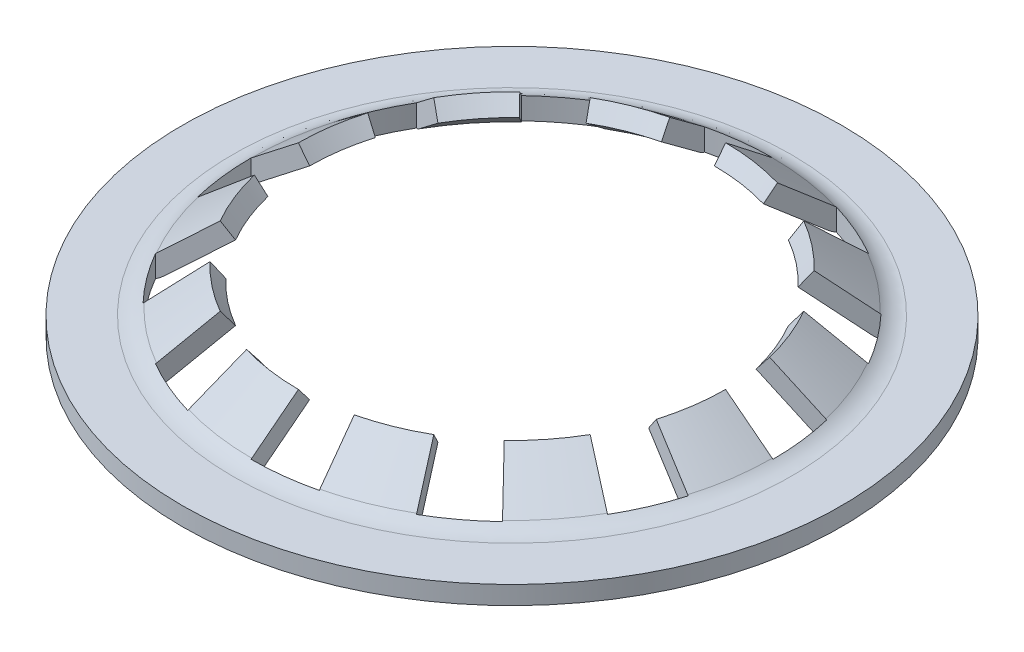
ISO-10303-21;
HEADER;
FILE_DESCRIPTION(('STEP AP214'),'2;1');
FILE_NAME('part.step','',(''),(''),'','','');
FILE_SCHEMA(('AUTOMOTIVE_DESIGN { 1 0 10303 214 1 1 1 1 }'));
ENDSEC;
DATA;
#1=APPLICATION_CONTEXT('core data for automotive mechanical design processes');
#2=APPLICATION_PROTOCOL_DEFINITION('international standard','automotive_design',2000,#1);
#3=PRODUCT_CONTEXT('',#1,'mechanical');
#4=PRODUCT('Part','Part','',(#3));
#5=PRODUCT_RELATED_PRODUCT_CATEGORY('part','',(#4));
#6=PRODUCT_DEFINITION_FORMATION('','',#4);
#7=PRODUCT_DEFINITION_CONTEXT('part definition',#1,'design');
#8=PRODUCT_DEFINITION('design','',#6,#7);
#9=PRODUCT_DEFINITION_SHAPE('','',#8);
#10=(LENGTH_UNIT() NAMED_UNIT(*) SI_UNIT(.MILLI.,.METRE.));
#11=(NAMED_UNIT(*) PLANE_ANGLE_UNIT() SI_UNIT($,.RADIAN.));
#12=(NAMED_UNIT(*) SI_UNIT($,.STERADIAN.) SOLID_ANGLE_UNIT());
#13=UNCERTAINTY_MEASURE_WITH_UNIT(LENGTH_MEASURE(1.E-05),#10,'distance_accuracy_value','');
#14=(GEOMETRIC_REPRESENTATION_CONTEXT(3) GLOBAL_UNCERTAINTY_ASSIGNED_CONTEXT((#13)) GLOBAL_UNIT_ASSIGNED_CONTEXT((#10,
#11,#12)) REPRESENTATION_CONTEXT('',''));
#15=CARTESIAN_POINT('',(0.,0.,0.));
#16=DIRECTION('',(0.,0.,1.));
#17=DIRECTION('',(1.,0.,0.));
#18=AXIS2_PLACEMENT_3D('',#15,#16,#17);
#19=CARTESIAN_POINT('',(0.,0.405323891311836,0.));
#20=DIRECTION('',(0.,-1.,0.));
#21=DIRECTION('',(0.,0.,-1.));
#22=AXIS2_PLACEMENT_3D('',#19,#20,#21);
#23=CONICAL_SURFACE('',#22,4.26458356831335,0.909753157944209);
#24=CARTESIAN_POINT('',(0.,0.405323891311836,0.));
#25=DIRECTION('',(0.,1.,0.));
#26=DIRECTION('',(0.,0.,1.));
#27=AXIS2_PLACEMENT_3D('',#24,#25,#26);
#28=CIRCLE('',#27,4.26458356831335);
#29=CARTESIAN_POINT('',(1.20952102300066,0.405323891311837,-4.08946596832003));
#30=VERTEX_POINT('',#29);
#31=CARTESIAN_POINT('',(0.,0.405323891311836,-4.26458356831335));
#32=VERTEX_POINT('',#31);
#33=EDGE_CURVE('E1166',#30,#32,#28,.T.);
#34=ORIENTED_EDGE('',*,*,#33,.T.);
#35=DIRECTION('',(0.,0.613940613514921,0.789352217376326));
#36=VECTOR('',#35,1.);
#37=CARTESIAN_POINT('',(0.,3.72222222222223,0.));
#38=LINE('',#37,#36);
#39=CARTESIAN_POINT('',(0.,1.,-3.5));
#40=VERTEX_POINT('',#39);
#41=EDGE_CURVE('E497',#32,#40,#38,.T.);
#42=ORIENTED_EDGE('',*,*,#41,.T.);
#43=CARTESIAN_POINT('',(0.,1.,0.));
#44=DIRECTION('',(0.,1.,0.));
#45=DIRECTION('',(0.,0.,1.));
#46=AXIS2_PLACEMENT_3D('',#43,#44,#45);
#47=CIRCLE('',#46,3.5);
#48=CARTESIAN_POINT('',(0.992669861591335,1.,-3.3562786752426));
#49=VERTEX_POINT('',#48);
#50=EDGE_CURVE('E491',#49,#40,#47,.T.);
#51=ORIENTED_EDGE('',*,*,#50,.F.);
#52=DIRECTION('',(0.223876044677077,-0.613940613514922,-0.756938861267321));
#53=VECTOR('',#52,1.);
#54=CARTESIAN_POINT('',(0.,3.72222222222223,0.));
#55=LINE('',#54,#53);
#56=EDGE_CURVE('E473',#49,#30,#55,.T.);
#57=ORIENTED_EDGE('',*,*,#56,.T.);
#58=EDGE_LOOP('',(#34,#42,#51,#57));
#59=FACE_BOUND('',#58,.T.);
#60=ADVANCED_FACE('F25',(#59),#23,.T.);
#61=CARTESIAN_POINT('',(-0.818462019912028,1.,-3.40295752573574));
#62=VERTEX_POINT('',#61);
#63=CARTESIAN_POINT('',(-1.75000000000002,1.,-3.03108891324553));
#64=VERTEX_POINT('',#63);
#65=EDGE_CURVE('E499',#62,#64,#47,.T.);
#66=ORIENTED_EDGE('',*,*,#65,.F.);
#67=DIRECTION('',(-0.184587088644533,-0.613940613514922,-0.767466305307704));
#68=VECTOR('',#67,1.);
#69=CARTESIAN_POINT('',(0.,3.72222222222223,0.));
#70=LINE('',#69,#68);
#71=CARTESIAN_POINT('',(-0.997257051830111,0.405323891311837,-4.1463419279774));
#72=VERTEX_POINT('',#71);
#73=EDGE_CURVE('E1002',#62,#72,#70,.T.);
#74=ORIENTED_EDGE('',*,*,#73,.T.);
#75=CARTESIAN_POINT('',(-2.13229178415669,0.405323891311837,-3.69323770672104));
#76=VERTEX_POINT('',#75);
#77=EDGE_CURVE('E1167',#72,#76,#28,.T.);
#78=ORIENTED_EDGE('',*,*,#77,.T.);
#79=DIRECTION('',(0.394676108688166,0.613940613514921,0.683599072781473));
#80=VECTOR('',#79,1.);
#81=CARTESIAN_POINT('',(0.,3.72222222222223,0.));
#82=LINE('',#81,#80);
#83=EDGE_CURVE('E990',#76,#64,#82,.T.);
#84=ORIENTED_EDGE('',*,*,#83,.T.);
#85=EDGE_LOOP('',(#66,#74,#78,#84));
#86=FACE_BOUND('',#85,.T.);
#87=ADVANCED_FACE('F1251',(#86),#23,.T.);
#88=CARTESIAN_POINT('',(-2.41028766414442,1.,-2.53781665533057));
#89=VERTEX_POINT('',#88);
#90=CARTESIAN_POINT('',(-3.03108891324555,1.,-1.74999999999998));
#91=VERTEX_POINT('',#90);
#92=EDGE_CURVE('E504',#89,#91,#47,.T.);
#93=ORIENTED_EDGE('',*,*,#92,.F.);
#94=DIRECTION('',(-0.543590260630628,-0.613940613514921,-0.572351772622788));
#95=VECTOR('',#94,1.);
#96=CARTESIAN_POINT('',(0.,3.72222222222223,0.));
#97=LINE('',#96,#95);
#98=CARTESIAN_POINT('',(-2.93682090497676,0.405323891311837,-3.09220891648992));
#99=VERTEX_POINT('',#98);
#100=EDGE_CURVE('E975',#89,#99,#97,.T.);
#101=ORIENTED_EDGE('',*,*,#100,.T.);
#102=CARTESIAN_POINT('',(-3.69323770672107,0.405323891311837,-2.13229178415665));
#103=VERTEX_POINT('',#102);
#104=EDGE_CURVE('E1169',#99,#103,#28,.T.);
#105=ORIENTED_EDGE('',*,*,#104,.T.);
#106=DIRECTION('',(0.683599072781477,0.613940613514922,0.394676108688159));
#107=VECTOR('',#106,1.);
#108=CARTESIAN_POINT('',(0.,3.72222222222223,0.));
#109=LINE('',#108,#107);
#110=EDGE_CURVE('E963',#103,#91,#109,.T.);
#111=ORIENTED_EDGE('',*,*,#110,.T.);
#112=EDGE_LOOP('',(#93,#101,#105,#111));
#113=FACE_BOUND('',#112,.T.);
#114=ADVANCED_FACE('F1257',(#113),#23,.T.);
#115=CARTESIAN_POINT('',(-3.35627867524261,1.,-0.992669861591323));
#116=VERTEX_POINT('',#115);
#117=CARTESIAN_POINT('',(-3.5,1.,0.));
#118=VERTEX_POINT('',#117);
#119=EDGE_CURVE('E1068',#116,#118,#47,.T.);
#120=ORIENTED_EDGE('',*,*,#119,.F.);
#121=DIRECTION('',(-0.756938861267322,-0.613940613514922,-0.223876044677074));
#122=VECTOR('',#121,1.);
#123=CARTESIAN_POINT('',(0.,3.72222222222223,0.));
#124=LINE('',#123,#122);
#125=CARTESIAN_POINT('',(-4.08946596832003,0.405323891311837,-1.20952102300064));
#126=VERTEX_POINT('',#125);
#127=EDGE_CURVE('E948',#116,#126,#124,.T.);
#128=ORIENTED_EDGE('',*,*,#127,.T.);
#129=CARTESIAN_POINT('',(-4.26458356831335,0.405323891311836,0.));
#130=VERTEX_POINT('',#129);
#131=EDGE_CURVE('E1173',#126,#130,#28,.T.);
#132=ORIENTED_EDGE('',*,*,#131,.T.);
#133=DIRECTION('',(0.789352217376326,0.613940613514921,0.));
#134=VECTOR('',#133,1.);
#135=CARTESIAN_POINT('',(0.,3.72222222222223,0.));
#136=LINE('',#135,#134);
#137=EDGE_CURVE('E936',#130,#118,#136,.T.);
#138=ORIENTED_EDGE('',*,*,#137,.T.);
#139=EDGE_LOOP('',(#120,#128,#132,#138));
#140=FACE_BOUND('',#139,.T.);
#141=ADVANCED_FACE('F1288',(#140),#23,.T.);
#142=CARTESIAN_POINT('',(-3.40295752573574,1.,0.818462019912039));
#143=VERTEX_POINT('',#142);
#144=CARTESIAN_POINT('',(-3.03108891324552,1.,1.75000000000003));
#145=VERTEX_POINT('',#144);
#146=EDGE_CURVE('E1066',#143,#145,#47,.T.);
#147=ORIENTED_EDGE('',*,*,#146,.F.);
#148=DIRECTION('',(-0.767466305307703,-0.613940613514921,0.184587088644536));
#149=VECTOR('',#148,1.);
#150=CARTESIAN_POINT('',(0.,3.72222222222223,0.));
#151=LINE('',#150,#149);
#152=CARTESIAN_POINT('',(-4.1463419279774,0.405323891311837,0.997257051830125));
#153=VERTEX_POINT('',#152);
#154=EDGE_CURVE('E921',#143,#153,#151,.T.);
#155=ORIENTED_EDGE('',*,*,#154,.T.);
#156=CARTESIAN_POINT('',(-3.69323770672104,0.405323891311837,2.13229178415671));
#157=VERTEX_POINT('',#156);
#158=EDGE_CURVE('E1177',#153,#157,#28,.T.);
#159=ORIENTED_EDGE('',*,*,#158,.T.);
#160=DIRECTION('',(0.683599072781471,0.613940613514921,-0.394676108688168));
#161=VECTOR('',#160,1.);
#162=CARTESIAN_POINT('',(0.,3.72222222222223,0.));
#163=LINE('',#162,#161);
#164=EDGE_CURVE('E909',#157,#145,#163,.T.);
#165=ORIENTED_EDGE('',*,*,#164,.T.);
#166=EDGE_LOOP('',(#147,#155,#159,#165));
#167=FACE_BOUND('',#166,.T.);
#168=ADVANCED_FACE('F1182',(#167),#23,.T.);
#169=CARTESIAN_POINT('',(-2.53781665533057,1.,2.41028766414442));
#170=VERTEX_POINT('',#169);
#171=CARTESIAN_POINT('',(-1.74999999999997,1.,3.03108891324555));
#172=VERTEX_POINT('',#171);
#173=EDGE_CURVE('E509',#170,#172,#47,.T.);
#174=ORIENTED_EDGE('',*,*,#173,.F.);
#175=DIRECTION('',(-0.572351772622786,-0.613940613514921,0.54359026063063));
#176=VECTOR('',#175,1.);
#177=CARTESIAN_POINT('',(0.,3.72222222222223,0.));
#178=LINE('',#177,#176);
#179=CARTESIAN_POINT('',(-3.09220891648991,0.405323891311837,2.93682090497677));
#180=VERTEX_POINT('',#179);
#181=EDGE_CURVE('E894',#170,#180,#178,.T.);
#182=ORIENTED_EDGE('',*,*,#181,.T.);
#183=CARTESIAN_POINT('',(-2.13229178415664,0.405323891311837,3.69323770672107));
#184=VERTEX_POINT('',#183);
#185=EDGE_CURVE('E517',#180,#184,#28,.T.);
#186=ORIENTED_EDGE('',*,*,#185,.T.);
#187=DIRECTION('',(0.394676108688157,0.613940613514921,-0.683599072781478));
#188=VECTOR('',#187,1.);
#189=CARTESIAN_POINT('',(0.,3.72222222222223,0.));
#190=LINE('',#189,#188);
#191=EDGE_CURVE('E884',#184,#172,#190,.T.);
#192=ORIENTED_EDGE('',*,*,#191,.T.);
#193=EDGE_LOOP('',(#174,#182,#186,#192));
#194=FACE_BOUND('',#193,.T.);
#195=ADVANCED_FACE('F1077',(#194),#23,.T.);
#196=CARTESIAN_POINT('',(-0.992669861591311,1.,3.35627867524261));
#197=VERTEX_POINT('',#196);
#198=CARTESIAN_POINT('',(0.,1.,3.5));
#199=VERTEX_POINT('',#198);
#200=EDGE_CURVE('E505',#197,#199,#47,.T.);
#201=ORIENTED_EDGE('',*,*,#200,.F.);
#202=DIRECTION('',(-0.223876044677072,-0.613940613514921,0.756938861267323));
#203=VECTOR('',#202,1.);
#204=CARTESIAN_POINT('',(0.,3.72222222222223,0.));
#205=LINE('',#204,#203);
#206=CARTESIAN_POINT('',(-1.20952102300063,0.405323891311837,4.08946596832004));
#207=VERTEX_POINT('',#206);
#208=EDGE_CURVE('E869',#197,#207,#205,.T.);
#209=ORIENTED_EDGE('',*,*,#208,.T.);
#210=CARTESIAN_POINT('',(0.,0.405323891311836,4.26458356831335));
#211=VERTEX_POINT('',#210);
#212=EDGE_CURVE('E514',#207,#211,#28,.T.);
#213=ORIENTED_EDGE('',*,*,#212,.T.);
#214=DIRECTION('',(0.,0.613940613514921,-0.789352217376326));
#215=VECTOR('',#214,1.);
#216=CARTESIAN_POINT('',(0.,3.72222222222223,0.));
#217=LINE('',#216,#215);
#218=EDGE_CURVE('E859',#211,#199,#217,.T.);
#219=ORIENTED_EDGE('',*,*,#218,.T.);
#220=EDGE_LOOP('',(#201,#209,#213,#219));
#221=FACE_BOUND('',#220,.T.);
#222=ADVANCED_FACE('F1100',(#221),#23,.T.);
#223=CARTESIAN_POINT('',(0.818462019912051,1.,3.40295752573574));
#224=VERTEX_POINT('',#223);
#225=CARTESIAN_POINT('',(1.75000000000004,1.,3.03108891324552));
#226=VERTEX_POINT('',#225);
#227=EDGE_CURVE('E511',#224,#226,#47,.T.);
#228=ORIENTED_EDGE('',*,*,#227,.F.);
#229=DIRECTION('',(0.184587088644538,-0.613940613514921,0.767466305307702));
#230=VECTOR('',#229,1.);
#231=CARTESIAN_POINT('',(0.,3.72222222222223,0.));
#232=LINE('',#231,#230);
#233=CARTESIAN_POINT('',(0.99725705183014,0.405323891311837,4.14634192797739));
#234=VERTEX_POINT('',#233);
#235=EDGE_CURVE('E844',#224,#234,#232,.T.);
#236=ORIENTED_EDGE('',*,*,#235,.T.);
#237=CARTESIAN_POINT('',(2.13229178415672,0.405323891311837,3.69323770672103));
#238=VERTEX_POINT('',#237);
#239=EDGE_CURVE('E518',#234,#238,#28,.T.);
#240=ORIENTED_EDGE('',*,*,#239,.T.);
#241=DIRECTION('',(-0.39467610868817,0.613940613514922,-0.68359907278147));
#242=VECTOR('',#241,1.);
#243=CARTESIAN_POINT('',(0.,3.72222222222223,0.));
#244=LINE('',#243,#242);
#245=EDGE_CURVE('E832',#238,#226,#244,.T.);
#246=ORIENTED_EDGE('',*,*,#245,.T.);
#247=EDGE_LOOP('',(#228,#236,#240,#246));
#248=FACE_BOUND('',#247,.T.);
#249=ADVANCED_FACE('F1275',(#248),#23,.T.);
#250=CARTESIAN_POINT('',(2.41028766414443,1.,2.53781665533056));
#251=VERTEX_POINT('',#250);
#252=CARTESIAN_POINT('',(3.03108891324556,1.,1.74999999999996));
#253=VERTEX_POINT('',#252);
#254=EDGE_CURVE('E1119',#251,#253,#47,.T.);
#255=ORIENTED_EDGE('',*,*,#254,.F.);
#256=DIRECTION('',(0.543590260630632,-0.613940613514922,0.572351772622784));
#257=VECTOR('',#256,1.);
#258=CARTESIAN_POINT('',(0.,3.72222222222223,0.));
#259=LINE('',#258,#257);
#260=CARTESIAN_POINT('',(2.93682090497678,0.405323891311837,3.0922089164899));
#261=VERTEX_POINT('',#260);
#262=EDGE_CURVE('E817',#251,#261,#259,.T.);
#263=ORIENTED_EDGE('',*,*,#262,.T.);
#264=CARTESIAN_POINT('',(3.69323770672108,0.405323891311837,2.13229178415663));
#265=VERTEX_POINT('',#264);
#266=EDGE_CURVE('E1220',#261,#265,#28,.T.);
#267=ORIENTED_EDGE('',*,*,#266,.T.);
#268=DIRECTION('',(-0.683599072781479,0.613940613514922,-0.394676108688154));
#269=VECTOR('',#268,1.);
#270=CARTESIAN_POINT('',(0.,3.72222222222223,0.));
#271=LINE('',#270,#269);
#272=EDGE_CURVE('E805',#265,#253,#271,.T.);
#273=ORIENTED_EDGE('',*,*,#272,.T.);
#274=EDGE_LOOP('',(#255,#263,#267,#273));
#275=FACE_BOUND('',#274,.T.);
#276=ADVANCED_FACE('F1218',(#275),#23,.T.);
#277=CARTESIAN_POINT('',(3.35627867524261,1.,0.992669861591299));
#278=VERTEX_POINT('',#277);
#279=CARTESIAN_POINT('',(3.5,1.,0.));
#280=VERTEX_POINT('',#279);
#281=EDGE_CURVE('E1121',#278,#280,#47,.T.);
#282=ORIENTED_EDGE('',*,*,#281,.F.);
#283=DIRECTION('',(0.756938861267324,-0.613940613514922,0.223876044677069));
#284=VECTOR('',#283,1.);
#285=CARTESIAN_POINT('',(0.,3.72222222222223,0.));
#286=LINE('',#285,#284);
#287=CARTESIAN_POINT('',(4.08946596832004,0.405323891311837,1.20952102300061));
#288=VERTEX_POINT('',#287);
#289=EDGE_CURVE('E790',#278,#288,#286,.T.);
#290=ORIENTED_EDGE('',*,*,#289,.T.);
#291=CARTESIAN_POINT('',(4.26458356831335,0.405323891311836,0.));
#292=VERTEX_POINT('',#291);
#293=EDGE_CURVE('E1221',#288,#292,#28,.T.);
#294=ORIENTED_EDGE('',*,*,#293,.T.);
#295=DIRECTION('',(-0.789352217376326,0.613940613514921,0.));
#296=VECTOR('',#295,1.);
#297=CARTESIAN_POINT('',(0.,3.72222222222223,0.));
#298=LINE('',#297,#296);
#299=EDGE_CURVE('E778',#292,#280,#298,.T.);
#300=ORIENTED_EDGE('',*,*,#299,.T.);
#301=EDGE_LOOP('',(#282,#290,#294,#300));
#302=FACE_BOUND('',#301,.T.);
#303=ADVANCED_FACE('F1226',(#302),#23,.T.);
#304=CARTESIAN_POINT('',(3.40295752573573,1.,-0.818462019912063));
#305=VERTEX_POINT('',#304);
#306=CARTESIAN_POINT('',(3.03108891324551,1.,-1.75000000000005));
#307=VERTEX_POINT('',#306);
#308=EDGE_CURVE('E502',#305,#307,#47,.T.);
#309=ORIENTED_EDGE('',*,*,#308,.F.);
#310=DIRECTION('',(0.767466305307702,-0.613940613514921,-0.184587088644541));
#311=VECTOR('',#310,1.);
#312=CARTESIAN_POINT('',(0.,3.72222222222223,0.));
#313=LINE('',#312,#311);
#314=CARTESIAN_POINT('',(4.14634192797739,0.405323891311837,-0.997257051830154));
#315=VERTEX_POINT('',#314);
#316=EDGE_CURVE('E763',#305,#315,#313,.T.);
#317=ORIENTED_EDGE('',*,*,#316,.T.);
#318=CARTESIAN_POINT('',(3.69323770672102,0.405323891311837,-2.13229178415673));
#319=VERTEX_POINT('',#318);
#320=EDGE_CURVE('E1137',#315,#319,#28,.T.);
#321=ORIENTED_EDGE('',*,*,#320,.T.);
#322=DIRECTION('',(-0.683599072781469,0.613940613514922,0.394676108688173));
#323=VECTOR('',#322,1.);
#324=CARTESIAN_POINT('',(0.,3.72222222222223,0.));
#325=LINE('',#324,#323);
#326=EDGE_CURVE('E751',#319,#307,#325,.T.);
#327=ORIENTED_EDGE('',*,*,#326,.T.);
#328=EDGE_LOOP('',(#309,#317,#321,#327));
#329=FACE_BOUND('',#328,.T.);
#330=ADVANCED_FACE('F1134',(#329),#23,.T.);
#331=CARTESIAN_POINT('',(0.,1.,0.));
#332=DIRECTION('',(0.,1.,0.));
#333=DIRECTION('',(0.,0.,1.));
#334=AXIS2_PLACEMENT_3D('',#331,#332,#333);
#335=CONICAL_SURFACE('',#334,3.5,0.661043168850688);
#336=ORIENTED_EDGE('',*,*,#50,.T.);
#337=DIRECTION('',(0.,0.789352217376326,-0.613940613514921));
#338=VECTOR('',#337,1.);
#339=CARTESIAN_POINT('',(0.,-3.49999999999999,0.));
#340=LINE('',#339,#338);
#341=CARTESIAN_POINT('',(0.,0.763194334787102,-3.31581781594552));
#342=VERTEX_POINT('',#341);
#343=EDGE_CURVE('E1012',#40,#342,#340,.F.);
#344=ORIENTED_EDGE('',*,*,#343,.T.);
#345=CARTESIAN_POINT('',(0.,0.763194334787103,0.));
#346=DIRECTION('',(0.,1.,0.));
#347=DIRECTION('',(0.,0.,1.));
#348=AXIS2_PLACEMENT_3D('',#345,#346,#347);
#349=CIRCLE('',#348,3.31581781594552);
#350=CARTESIAN_POINT('',(0.94043211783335,0.763194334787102,-3.17965960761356));
#351=VERTEX_POINT('',#350);
#352=EDGE_CURVE('E493',#351,#342,#349,.T.);
#353=ORIENTED_EDGE('',*,*,#352,.F.);
#354=DIRECTION('',(-0.174125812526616,-0.789352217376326,0.588730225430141));
#355=VECTOR('',#354,1.);
#356=CARTESIAN_POINT('',(0.,-3.49999999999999,0.));
#357=LINE('',#356,#355);
#358=EDGE_CURVE('E476',#351,#49,#357,.F.);
#359=ORIENTED_EDGE('',*,*,#358,.T.);
#360=EDGE_LOOP('',(#336,#344,#353,#359));
#361=FACE_BOUND('',#360,.T.);
#362=ADVANCED_FACE('F489',(#361),#335,.F.);
#363=CARTESIAN_POINT('',(-0.775391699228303,0.763194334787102,-3.22388205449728));
#364=VERTEX_POINT('',#363);
#365=CARTESIAN_POINT('',(-1.65790890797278,0.763194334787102,-2.87158246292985));
#366=VERTEX_POINT('',#365);
#367=EDGE_CURVE('E1196',#364,#366,#349,.T.);
#368=ORIENTED_EDGE('',*,*,#367,.F.);
#369=DIRECTION('',(0.143567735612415,-0.789352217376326,0.596918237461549));
#370=VECTOR('',#369,1.);
#371=CARTESIAN_POINT('',(0.,-3.49999999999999,0.));
#372=LINE('',#371,#370);
#373=EDGE_CURVE('E999',#364,#62,#372,.F.);
#374=ORIENTED_EDGE('',*,*,#373,.T.);
#375=ORIENTED_EDGE('',*,*,#65,.T.);
#376=DIRECTION('',(-0.306970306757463,0.789352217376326,-0.531688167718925));
#377=VECTOR('',#376,1.);
#378=CARTESIAN_POINT('',(0.,-3.49999999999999,0.));
#379=LINE('',#378,#377);
#380=EDGE_CURVE('E987',#64,#366,#379,.F.);
#381=ORIENTED_EDGE('',*,*,#380,.T.);
#382=EDGE_LOOP('',(#368,#374,#375,#381));
#383=FACE_BOUND('',#382,.T.);
#384=ADVANCED_FACE('F1271',(#383),#335,.F.);
#385=CARTESIAN_POINT('',(-2.28344993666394,0.763194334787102,-2.40426790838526));
#386=VERTEX_POINT('',#385);
#387=CARTESIAN_POINT('',(-2.87158246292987,0.763194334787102,-1.65790890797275));
#388=VERTEX_POINT('',#387);
#389=EDGE_CURVE('E1192',#386,#388,#349,.T.);
#390=ORIENTED_EDGE('',*,*,#389,.F.);
#391=DIRECTION('',(0.422792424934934,-0.789352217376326,0.445162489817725));
#392=VECTOR('',#391,1.);
#393=CARTESIAN_POINT('',(0.,-3.49999999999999,0.));
#394=LINE('',#393,#392);
#395=EDGE_CURVE('E972',#386,#89,#394,.F.);
#396=ORIENTED_EDGE('',*,*,#395,.T.);
#397=ORIENTED_EDGE('',*,*,#92,.T.);
#398=DIRECTION('',(-0.531688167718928,0.789352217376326,-0.306970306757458));
#399=VECTOR('',#398,1.);
#400=CARTESIAN_POINT('',(0.,-3.49999999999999,0.));
#401=LINE('',#400,#399);
#402=EDGE_CURVE('E960',#91,#388,#401,.F.);
#403=ORIENTED_EDGE('',*,*,#402,.T.);
#404=EDGE_LOOP('',(#390,#396,#397,#403));
#405=FACE_BOUND('',#404,.T.);
#406=ADVANCED_FACE('F1432',(#405),#335,.F.);
#407=CARTESIAN_POINT('',(-3.17965960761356,0.763194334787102,-0.940432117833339));
#408=VERTEX_POINT('',#407);
#409=CARTESIAN_POINT('',(-3.31581781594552,0.763194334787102,0.));
#410=VERTEX_POINT('',#409);
#411=EDGE_CURVE('E1190',#408,#410,#349,.T.);
#412=ORIENTED_EDGE('',*,*,#411,.F.);
#413=DIRECTION('',(0.588730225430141,-0.789352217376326,0.174125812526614));
#414=VECTOR('',#413,1.);
#415=CARTESIAN_POINT('',(0.,-3.49999999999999,0.));
#416=LINE('',#415,#414);
#417=EDGE_CURVE('E945',#408,#116,#416,.F.);
#418=ORIENTED_EDGE('',*,*,#417,.T.);
#419=ORIENTED_EDGE('',*,*,#119,.T.);
#420=DIRECTION('',(-0.613940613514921,0.789352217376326,0.));
#421=VECTOR('',#420,1.);
#422=CARTESIAN_POINT('',(0.,-3.49999999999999,0.));
#423=LINE('',#422,#421);
#424=EDGE_CURVE('E933',#118,#410,#423,.F.);
#425=ORIENTED_EDGE('',*,*,#424,.T.);
#426=EDGE_LOOP('',(#412,#418,#419,#425));
#427=FACE_BOUND('',#426,.T.);
#428=ADVANCED_FACE('F1297',(#427),#335,.F.);
#429=CARTESIAN_POINT('',(-3.22388205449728,0.763194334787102,0.775391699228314));
#430=VERTEX_POINT('',#429);
#431=CARTESIAN_POINT('',(-2.87158246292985,0.763194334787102,1.65790890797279));
#432=VERTEX_POINT('',#431);
#433=EDGE_CURVE('E1059',#430,#432,#349,.T.);
#434=ORIENTED_EDGE('',*,*,#433,.F.);
#435=DIRECTION('',(0.596918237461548,-0.789352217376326,-0.143567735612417));
#436=VECTOR('',#435,1.);
#437=CARTESIAN_POINT('',(0.,-3.49999999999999,0.));
#438=LINE('',#437,#436);
#439=EDGE_CURVE('E918',#430,#143,#438,.F.);
#440=ORIENTED_EDGE('',*,*,#439,.T.);
#441=ORIENTED_EDGE('',*,*,#146,.T.);
#442=DIRECTION('',(-0.531688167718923,0.789352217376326,0.306970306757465));
#443=VECTOR('',#442,1.);
#444=CARTESIAN_POINT('',(0.,-3.49999999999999,0.));
#445=LINE('',#444,#443);
#446=EDGE_CURVE('E906',#145,#432,#445,.F.);
#447=ORIENTED_EDGE('',*,*,#446,.T.);
#448=EDGE_LOOP('',(#434,#440,#441,#447));
#449=FACE_BOUND('',#448,.T.);
#450=ADVANCED_FACE('F1064',(#449),#335,.F.);
#451=CARTESIAN_POINT('',(-2.40426790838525,0.763194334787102,2.28344993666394));
#452=VERTEX_POINT('',#451);
#453=CARTESIAN_POINT('',(-1.65790890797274,0.763194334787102,2.87158246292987));
#454=VERTEX_POINT('',#453);
#455=EDGE_CURVE('E1032',#452,#454,#349,.T.);
#456=ORIENTED_EDGE('',*,*,#455,.F.);
#457=DIRECTION('',(0.445162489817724,-0.789352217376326,-0.422792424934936));
#458=VECTOR('',#457,1.);
#459=CARTESIAN_POINT('',(0.,-3.49999999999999,0.));
#460=LINE('',#459,#458);
#461=EDGE_CURVE('E891',#452,#170,#460,.F.);
#462=ORIENTED_EDGE('',*,*,#461,.T.);
#463=ORIENTED_EDGE('',*,*,#173,.T.);
#464=DIRECTION('',(-0.306970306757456,0.789352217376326,0.531688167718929));
#465=VECTOR('',#464,1.);
#466=CARTESIAN_POINT('',(0.,-3.49999999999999,0.));
#467=LINE('',#466,#465);
#468=EDGE_CURVE('E881',#172,#454,#467,.F.);
#469=ORIENTED_EDGE('',*,*,#468,.T.);
#470=EDGE_LOOP('',(#456,#462,#463,#469));
#471=FACE_BOUND('',#470,.T.);
#472=ADVANCED_FACE('F1074',(#471),#335,.F.);
#473=CARTESIAN_POINT('',(-0.940432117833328,0.763194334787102,3.17965960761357));
#474=VERTEX_POINT('',#473);
#475=CARTESIAN_POINT('',(0.,0.763194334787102,3.31581781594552));
#476=VERTEX_POINT('',#475);
#477=EDGE_CURVE('E512',#474,#476,#349,.T.);
#478=ORIENTED_EDGE('',*,*,#477,.F.);
#479=DIRECTION('',(0.174125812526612,-0.789352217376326,-0.588730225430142));
#480=VECTOR('',#479,1.);
#481=CARTESIAN_POINT('',(0.,-3.49999999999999,0.));
#482=LINE('',#481,#480);
#483=EDGE_CURVE('E866',#474,#197,#482,.F.);
#484=ORIENTED_EDGE('',*,*,#483,.T.);
#485=ORIENTED_EDGE('',*,*,#200,.T.);
#486=DIRECTION('',(0.,0.789352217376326,0.613940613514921));
#487=VECTOR('',#486,1.);
#488=CARTESIAN_POINT('',(0.,-3.49999999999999,0.));
#489=LINE('',#488,#487);
#490=EDGE_CURVE('E856',#199,#476,#489,.F.);
#491=ORIENTED_EDGE('',*,*,#490,.T.);
#492=EDGE_LOOP('',(#478,#484,#485,#491));
#493=FACE_BOUND('',#492,.T.);
#494=ADVANCED_FACE('F1097',(#493),#335,.F.);
#495=CARTESIAN_POINT('',(0.775391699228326,0.763194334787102,3.22388205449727));
#496=VERTEX_POINT('',#495);
#497=CARTESIAN_POINT('',(1.6579089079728,0.763194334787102,2.87158246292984));
#498=VERTEX_POINT('',#497);
#499=EDGE_CURVE('E510',#496,#498,#349,.T.);
#500=ORIENTED_EDGE('',*,*,#499,.F.);
#501=DIRECTION('',(-0.143567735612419,-0.789352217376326,-0.596918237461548));
#502=VECTOR('',#501,1.);
#503=CARTESIAN_POINT('',(0.,-3.49999999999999,0.));
#504=LINE('',#503,#502);
#505=EDGE_CURVE('E841',#496,#224,#504,.F.);
#506=ORIENTED_EDGE('',*,*,#505,.T.);
#507=ORIENTED_EDGE('',*,*,#227,.T.);
#508=DIRECTION('',(0.306970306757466,0.789352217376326,0.531688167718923));
#509=VECTOR('',#508,1.);
#510=CARTESIAN_POINT('',(0.,-3.49999999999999,0.));
#511=LINE('',#510,#509);
#512=EDGE_CURVE('E829',#226,#498,#511,.F.);
#513=ORIENTED_EDGE('',*,*,#512,.T.);
#514=EDGE_LOOP('',(#500,#506,#507,#513));
#515=FACE_BOUND('',#514,.T.);
#516=ADVANCED_FACE('F1116',(#515),#335,.F.);
#517=CARTESIAN_POINT('',(2.28344993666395,0.763194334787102,2.40426790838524));
#518=VERTEX_POINT('',#517);
#519=CARTESIAN_POINT('',(2.87158246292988,0.763194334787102,1.65790890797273));
#520=VERTEX_POINT('',#519);
#521=EDGE_CURVE('E1206',#518,#520,#349,.T.);
#522=ORIENTED_EDGE('',*,*,#521,.F.);
#523=DIRECTION('',(-0.422792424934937,-0.789352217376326,-0.445162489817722));
#524=VECTOR('',#523,1.);
#525=CARTESIAN_POINT('',(0.,-3.49999999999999,0.));
#526=LINE('',#525,#524);
#527=EDGE_CURVE('E814',#518,#251,#526,.F.);
#528=ORIENTED_EDGE('',*,*,#527,.T.);
#529=ORIENTED_EDGE('',*,*,#254,.T.);
#530=DIRECTION('',(0.53168816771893,0.789352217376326,0.306970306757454));
#531=VECTOR('',#530,1.);
#532=CARTESIAN_POINT('',(0.,-3.49999999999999,0.));
#533=LINE('',#532,#531);
#534=EDGE_CURVE('E802',#253,#520,#533,.F.);
#535=ORIENTED_EDGE('',*,*,#534,.T.);
#536=EDGE_LOOP('',(#522,#528,#529,#535));
#537=FACE_BOUND('',#536,.T.);
#538=ADVANCED_FACE('F1213',(#537),#335,.F.);
#539=CARTESIAN_POINT('',(3.17965960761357,0.763194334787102,0.940432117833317));
#540=VERTEX_POINT('',#539);
#541=CARTESIAN_POINT('',(3.31581781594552,0.763194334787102,0.));
#542=VERTEX_POINT('',#541);
#543=EDGE_CURVE('E1203',#540,#542,#349,.T.);
#544=ORIENTED_EDGE('',*,*,#543,.F.);
#545=DIRECTION('',(-0.588730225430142,-0.789352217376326,-0.17412581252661));
#546=VECTOR('',#545,1.);
#547=CARTESIAN_POINT('',(0.,-3.49999999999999,0.));
#548=LINE('',#547,#546);
#549=EDGE_CURVE('E787',#540,#278,#548,.F.);
#550=ORIENTED_EDGE('',*,*,#549,.T.);
#551=ORIENTED_EDGE('',*,*,#281,.T.);
#552=DIRECTION('',(0.613940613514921,0.789352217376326,0.));
#553=VECTOR('',#552,1.);
#554=CARTESIAN_POINT('',(0.,-3.49999999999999,0.));
#555=LINE('',#554,#553);
#556=EDGE_CURVE('E775',#280,#542,#555,.F.);
#557=ORIENTED_EDGE('',*,*,#556,.T.);
#558=EDGE_LOOP('',(#544,#550,#551,#557));
#559=FACE_BOUND('',#558,.T.);
#560=ADVANCED_FACE('F1235',(#559),#335,.F.);
#561=CARTESIAN_POINT('',(3.22388205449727,0.763194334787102,-0.775391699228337));
#562=VERTEX_POINT('',#561);
#563=CARTESIAN_POINT('',(2.87158246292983,0.763194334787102,-1.65790890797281));
#564=VERTEX_POINT('',#563);
#565=EDGE_CURVE('E1202',#562,#564,#349,.T.);
#566=ORIENTED_EDGE('',*,*,#565,.F.);
#567=DIRECTION('',(-0.596918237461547,-0.789352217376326,0.143567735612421));
#568=VECTOR('',#567,1.);
#569=CARTESIAN_POINT('',(0.,-3.49999999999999,0.));
#570=LINE('',#569,#568);
#571=EDGE_CURVE('E760',#562,#305,#570,.F.);
#572=ORIENTED_EDGE('',*,*,#571,.T.);
#573=ORIENTED_EDGE('',*,*,#308,.T.);
#574=DIRECTION('',(0.531688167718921,0.789352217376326,-0.306970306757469));
#575=VECTOR('',#574,1.);
#576=CARTESIAN_POINT('',(0.,-3.49999999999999,0.));
#577=LINE('',#576,#575);
#578=EDGE_CURVE('E748',#307,#564,#577,.F.);
#579=ORIENTED_EDGE('',*,*,#578,.T.);
#580=EDGE_LOOP('',(#566,#572,#573,#579));
#581=FACE_BOUND('',#580,.T.);
#582=ADVANCED_FACE('F1131',(#581),#335,.F.);
#583=CARTESIAN_POINT('',(0.,0.763194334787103,0.));
#584=DIRECTION('',(0.,-1.,0.));
#585=DIRECTION('',(0.,0.,-1.));
#586=AXIS2_PLACEMENT_3D('',#583,#584,#585);
#587=CONICAL_SURFACE('',#586,3.31581781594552,0.90975315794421);
#588=ORIENTED_EDGE('',*,*,#352,.T.);
#589=DIRECTION('',(0.,0.61394061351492,0.789352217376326));
#590=VECTOR('',#589,1.);
#591=CARTESIAN_POINT('',(0.,3.34216374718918,0.));
#592=LINE('',#591,#590);
#593=CARTESIAN_POINT('',(0.,0.105323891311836,-4.16165124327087));
#594=VERTEX_POINT('',#593);
#595=EDGE_CURVE('E1010',#342,#594,#592,.F.);
#596=ORIENTED_EDGE('',*,*,#595,.T.);
#597=CARTESIAN_POINT('',(0.,0.105323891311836,0.));
#598=DIRECTION('',(0.,1.,0.));
#599=DIRECTION('',(0.,0.,1.));
#600=AXIS2_PLACEMENT_3D('',#597,#598,#599);
#601=CIRCLE('',#600,4.16165124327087);
#602=CARTESIAN_POINT('',(1.1803273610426,0.105323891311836,-3.99076037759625));
#603=VERTEX_POINT('',#602);
#604=EDGE_CURVE('E1043',#603,#594,#601,.T.);
#605=ORIENTED_EDGE('',*,*,#604,.F.);
#606=DIRECTION('',(0.223876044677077,-0.61394061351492,-0.756938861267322));
#607=VECTOR('',#606,1.);
#608=CARTESIAN_POINT('',(0.,3.34216374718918,0.));
#609=LINE('',#608,#607);
#610=EDGE_CURVE('E494',#603,#351,#609,.F.);
#611=ORIENTED_EDGE('',*,*,#610,.T.);
#612=EDGE_LOOP('',(#588,#596,#605,#611));
#613=FACE_BOUND('',#612,.T.);
#614=ADVANCED_FACE('F1165',(#613),#587,.F.);
#615=CARTESIAN_POINT('',(-0.973186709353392,0.105323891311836,-4.04626354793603));
#616=VERTEX_POINT('',#615);
#617=CARTESIAN_POINT('',(-2.08082562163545,0.105323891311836,-3.60409569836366));
#618=VERTEX_POINT('',#617);
#619=EDGE_CURVE('E1045',#616,#618,#601,.T.);
#620=ORIENTED_EDGE('',*,*,#619,.F.);
#621=DIRECTION('',(-0.184587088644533,-0.61394061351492,-0.767466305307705));
#622=VECTOR('',#621,1.);
#623=CARTESIAN_POINT('',(0.,3.34216374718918,0.));
#624=LINE('',#623,#622);
#625=EDGE_CURVE('E996',#616,#364,#624,.F.);
#626=ORIENTED_EDGE('',*,*,#625,.T.);
#627=ORIENTED_EDGE('',*,*,#367,.T.);
#628=DIRECTION('',(0.394676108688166,0.61394061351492,0.683599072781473));
#629=VECTOR('',#628,1.);
#630=CARTESIAN_POINT('',(0.,3.34216374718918,0.));
#631=LINE('',#630,#629);
#632=EDGE_CURVE('E984',#366,#618,#631,.F.);
#633=ORIENTED_EDGE('',*,*,#632,.T.);
#634=EDGE_LOOP('',(#620,#626,#627,#633));
#635=FACE_BOUND('',#634,.T.);
#636=ADVANCED_FACE('F1517',(#635),#587,.F.);
#637=CARTESIAN_POINT('',(-2.86593618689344,0.105323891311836,-3.01757366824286));
#638=VERTEX_POINT('',#637);
#639=CARTESIAN_POINT('',(-3.60409569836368,0.105323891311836,-2.08082562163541));
#640=VERTEX_POINT('',#639);
#641=EDGE_CURVE('E1047',#638,#640,#601,.T.);
#642=ORIENTED_EDGE('',*,*,#641,.F.);
#643=DIRECTION('',(-0.543590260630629,-0.61394061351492,-0.572351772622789));
#644=VECTOR('',#643,1.);
#645=CARTESIAN_POINT('',(0.,3.34216374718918,0.));
#646=LINE('',#645,#644);
#647=EDGE_CURVE('E969',#638,#386,#646,.F.);
#648=ORIENTED_EDGE('',*,*,#647,.T.);
#649=ORIENTED_EDGE('',*,*,#389,.T.);
#650=DIRECTION('',(0.683599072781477,0.61394061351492,0.394676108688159));
#651=VECTOR('',#650,1.);
#652=CARTESIAN_POINT('',(0.,3.34216374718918,0.));
#653=LINE('',#652,#651);
#654=EDGE_CURVE('E957',#388,#640,#653,.F.);
#655=ORIENTED_EDGE('',*,*,#654,.T.);
#656=EDGE_LOOP('',(#642,#648,#649,#655));
#657=FACE_BOUND('',#656,.T.);
#658=ADVANCED_FACE('F1429',(#657),#587,.F.);
#659=CARTESIAN_POINT('',(-3.99076037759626,0.105323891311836,-1.18032736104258));
#660=VERTEX_POINT('',#659);
#661=CARTESIAN_POINT('',(-4.16165124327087,0.105323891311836,0.));
#662=VERTEX_POINT('',#661);
#663=EDGE_CURVE('E1049',#660,#662,#601,.T.);
#664=ORIENTED_EDGE('',*,*,#663,.F.);
#665=DIRECTION('',(-0.756938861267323,-0.61394061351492,-0.223876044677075));
#666=VECTOR('',#665,1.);
#667=CARTESIAN_POINT('',(0.,3.34216374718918,0.));
#668=LINE('',#667,#666);
#669=EDGE_CURVE('E942',#660,#408,#668,.F.);
#670=ORIENTED_EDGE('',*,*,#669,.T.);
#671=ORIENTED_EDGE('',*,*,#411,.T.);
#672=DIRECTION('',(0.789352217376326,0.61394061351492,0.));
#673=VECTOR('',#672,1.);
#674=CARTESIAN_POINT('',(0.,3.34216374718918,0.));
#675=LINE('',#674,#673);
#676=EDGE_CURVE('E930',#410,#662,#675,.F.);
#677=ORIENTED_EDGE('',*,*,#676,.T.);
#678=EDGE_LOOP('',(#664,#670,#671,#677));
#679=FACE_BOUND('',#678,.T.);
#680=ADVANCED_FACE('F1300',(#679),#587,.F.);
#681=CARTESIAN_POINT('',(-4.04626354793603,0.105323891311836,0.973186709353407));
#682=VERTEX_POINT('',#681);
#683=CARTESIAN_POINT('',(-3.60409569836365,0.105323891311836,2.08082562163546));
#684=VERTEX_POINT('',#683);
#685=EDGE_CURVE('E1027',#682,#684,#601,.T.);
#686=ORIENTED_EDGE('',*,*,#685,.F.);
#687=DIRECTION('',(-0.767466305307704,-0.61394061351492,0.184587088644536));
#688=VECTOR('',#687,1.);
#689=CARTESIAN_POINT('',(0.,3.34216374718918,0.));
#690=LINE('',#689,#688);
#691=EDGE_CURVE('E915',#682,#430,#690,.F.);
#692=ORIENTED_EDGE('',*,*,#691,.T.);
#693=ORIENTED_EDGE('',*,*,#433,.T.);
#694=DIRECTION('',(0.683599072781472,0.61394061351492,-0.394676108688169));
#695=VECTOR('',#694,1.);
#696=CARTESIAN_POINT('',(0.,3.34216374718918,0.));
#697=LINE('',#696,#695);
#698=EDGE_CURVE('E903',#432,#684,#697,.F.);
#699=ORIENTED_EDGE('',*,*,#698,.T.);
#700=EDGE_LOOP('',(#686,#692,#693,#699));
#701=FACE_BOUND('',#700,.T.);
#702=ADVANCED_FACE('F1056',(#701),#587,.F.);
#703=CARTESIAN_POINT('',(-3.01757366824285,0.105323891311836,2.86593618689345));
#704=VERTEX_POINT('',#703);
#705=CARTESIAN_POINT('',(-2.0808256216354,0.105323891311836,3.60409569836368));
#706=VERTEX_POINT('',#705);
#707=EDGE_CURVE('E1023',#704,#706,#601,.T.);
#708=ORIENTED_EDGE('',*,*,#707,.F.);
#709=DIRECTION('',(-0.572351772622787,-0.61394061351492,0.543590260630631));
#710=VECTOR('',#709,1.);
#711=CARTESIAN_POINT('',(0.,3.34216374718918,0.));
#712=LINE('',#711,#710);
#713=EDGE_CURVE('E48',#704,#452,#712,.F.);
#714=ORIENTED_EDGE('',*,*,#713,.T.);
#715=ORIENTED_EDGE('',*,*,#455,.T.);
#716=DIRECTION('',(0.394676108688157,0.61394061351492,-0.683599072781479));
#717=VECTOR('',#716,1.);
#718=CARTESIAN_POINT('',(0.,3.34216374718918,0.));
#719=LINE('',#718,#717);
#720=EDGE_CURVE('E878',#454,#706,#719,.F.);
#721=ORIENTED_EDGE('',*,*,#720,.T.);
#722=EDGE_LOOP('',(#708,#714,#715,#721));
#723=FACE_BOUND('',#722,.T.);
#724=ADVANCED_FACE('F1189',(#723),#587,.F.);
#725=CARTESIAN_POINT('',(-1.18032736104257,0.105323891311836,3.99076037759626));
#726=VERTEX_POINT('',#725);
#727=CARTESIAN_POINT('',(0.,0.105323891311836,4.16165124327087));
#728=VERTEX_POINT('',#727);
#729=EDGE_CURVE('E1021',#726,#728,#601,.T.);
#730=ORIENTED_EDGE('',*,*,#729,.F.);
#731=DIRECTION('',(-0.223876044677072,-0.61394061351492,0.756938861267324));
#732=VECTOR('',#731,1.);
#733=CARTESIAN_POINT('',(0.,3.34216374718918,0.));
#734=LINE('',#733,#732);
#735=EDGE_CURVE('E40',#726,#474,#734,.F.);
#736=ORIENTED_EDGE('',*,*,#735,.T.);
#737=ORIENTED_EDGE('',*,*,#477,.T.);
#738=DIRECTION('',(0.,0.61394061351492,-0.789352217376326));
#739=VECTOR('',#738,1.);
#740=CARTESIAN_POINT('',(0.,3.34216374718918,0.));
#741=LINE('',#740,#739);
#742=EDGE_CURVE('E853',#476,#728,#741,.F.);
#743=ORIENTED_EDGE('',*,*,#742,.T.);
#744=EDGE_LOOP('',(#730,#736,#737,#743));
#745=FACE_BOUND('',#744,.T.);
#746=ADVANCED_FACE('F1092',(#745),#587,.F.);
#747=CARTESIAN_POINT('',(0.973186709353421,0.105323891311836,4.04626354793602));
#748=VERTEX_POINT('',#747);
#749=CARTESIAN_POINT('',(2.08082562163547,0.105323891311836,3.60409569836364));
#750=VERTEX_POINT('',#749);
#751=EDGE_CURVE('E1024',#748,#750,#601,.T.);
#752=ORIENTED_EDGE('',*,*,#751,.F.);
#753=DIRECTION('',(0.184587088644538,-0.61394061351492,0.767466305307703));
#754=VECTOR('',#753,1.);
#755=CARTESIAN_POINT('',(0.,3.34216374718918,0.));
#756=LINE('',#755,#754);
#757=EDGE_CURVE('E838',#748,#496,#756,.F.);
#758=ORIENTED_EDGE('',*,*,#757,.T.);
#759=ORIENTED_EDGE('',*,*,#499,.T.);
#760=DIRECTION('',(-0.394676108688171,0.61394061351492,-0.683599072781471));
#761=VECTOR('',#760,1.);
#762=CARTESIAN_POINT('',(0.,3.34216374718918,0.));
#763=LINE('',#762,#761);
#764=EDGE_CURVE('E826',#498,#750,#763,.F.);
#765=ORIENTED_EDGE('',*,*,#764,.T.);
#766=EDGE_LOOP('',(#752,#758,#759,#765));
#767=FACE_BOUND('',#766,.T.);
#768=ADVANCED_FACE('F1109',(#767),#587,.F.);
#769=CARTESIAN_POINT('',(2.86593618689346,0.105323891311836,3.01757366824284));
#770=VERTEX_POINT('',#769);
#771=CARTESIAN_POINT('',(3.60409569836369,0.105323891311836,2.08082562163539));
#772=VERTEX_POINT('',#771);
#773=EDGE_CURVE('E1029',#770,#772,#601,.T.);
#774=ORIENTED_EDGE('',*,*,#773,.F.);
#775=DIRECTION('',(0.543590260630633,-0.61394061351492,0.572351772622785));
#776=VECTOR('',#775,1.);
#777=CARTESIAN_POINT('',(0.,3.34216374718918,0.));
#778=LINE('',#777,#776);
#779=EDGE_CURVE('E811',#770,#518,#778,.F.);
#780=ORIENTED_EDGE('',*,*,#779,.T.);
#781=ORIENTED_EDGE('',*,*,#521,.T.);
#782=DIRECTION('',(-0.68359907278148,0.61394061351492,-0.394676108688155));
#783=VECTOR('',#782,1.);
#784=CARTESIAN_POINT('',(0.,3.34216374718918,0.));
#785=LINE('',#784,#783);
#786=EDGE_CURVE('E799',#520,#772,#785,.F.);
#787=ORIENTED_EDGE('',*,*,#786,.T.);
#788=EDGE_LOOP('',(#774,#780,#781,#787));
#789=FACE_BOUND('',#788,.T.);
#790=ADVANCED_FACE('F1212',(#789),#587,.F.);
#791=CARTESIAN_POINT('',(3.99076037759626,0.105323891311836,1.18032736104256));
#792=VERTEX_POINT('',#791);
#793=CARTESIAN_POINT('',(4.16165124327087,0.105323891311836,0.));
#794=VERTEX_POINT('',#793);
#795=EDGE_CURVE('E1034',#792,#794,#601,.T.);
#796=ORIENTED_EDGE('',*,*,#795,.F.);
#797=DIRECTION('',(0.756938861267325,-0.61394061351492,0.223876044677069));
#798=VECTOR('',#797,1.);
#799=CARTESIAN_POINT('',(0.,3.34216374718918,0.));
#800=LINE('',#799,#798);
#801=EDGE_CURVE('E784',#792,#540,#800,.F.);
#802=ORIENTED_EDGE('',*,*,#801,.T.);
#803=ORIENTED_EDGE('',*,*,#543,.T.);
#804=DIRECTION('',(-0.789352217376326,0.61394061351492,0.));
#805=VECTOR('',#804,1.);
#806=CARTESIAN_POINT('',(0.,3.34216374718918,0.));
#807=LINE('',#806,#805);
#808=EDGE_CURVE('E772',#542,#794,#807,.F.);
#809=ORIENTED_EDGE('',*,*,#808,.T.);
#810=EDGE_LOOP('',(#796,#802,#803,#809));
#811=FACE_BOUND('',#810,.T.);
#812=ADVANCED_FACE('F1233',(#811),#587,.F.);
#813=CARTESIAN_POINT('',(4.04626354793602,0.105323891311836,-0.973186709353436));
#814=VERTEX_POINT('',#813);
#815=CARTESIAN_POINT('',(3.60409569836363,0.105323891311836,-2.08082562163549));
#816=VERTEX_POINT('',#815);
#817=EDGE_CURVE('E1037',#814,#816,#601,.T.);
#818=ORIENTED_EDGE('',*,*,#817,.F.);
#819=DIRECTION('',(0.767466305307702,-0.61394061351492,-0.184587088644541));
#820=VECTOR('',#819,1.);
#821=CARTESIAN_POINT('',(0.,3.34216374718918,0.));
#822=LINE('',#821,#820);
#823=EDGE_CURVE('E757',#814,#562,#822,.F.);
#824=ORIENTED_EDGE('',*,*,#823,.T.);
#825=ORIENTED_EDGE('',*,*,#565,.T.);
#826=DIRECTION('',(-0.683599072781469,0.61394061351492,0.394676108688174));
#827=VECTOR('',#826,1.);
#828=CARTESIAN_POINT('',(0.,3.34216374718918,0.));
#829=LINE('',#828,#827);
#830=EDGE_CURVE('E745',#564,#816,#829,.F.);
#831=ORIENTED_EDGE('',*,*,#830,.T.);
#832=EDGE_LOOP('',(#818,#824,#825,#831));
#833=FACE_BOUND('',#832,.T.);
#834=ADVANCED_FACE('F1444',(#833),#587,.F.);
#835=CARTESIAN_POINT('',(0.,8.73430412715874,0.));
#836=DIRECTION('',(0.,1.,0.));
#837=DIRECTION('',(0.,0.,1.));
#838=AXIS2_PLACEMENT_3D('',#835,#836,#837);
#839=CYLINDRICAL_SURFACE('',#838,5.4);
#840=CARTESIAN_POINT('',(0.,0.3,0.));
#841=DIRECTION('',(0.,1.,0.));
#842=DIRECTION('',(0.,0.,1.));
#843=AXIS2_PLACEMENT_3D('',#840,#841,#842);
#844=CIRCLE('',#843,5.4);
#845=CARTESIAN_POINT('',(0.,0.3,5.4));
#846=VERTEX_POINT('',#845);
#847=EDGE_CURVE('E522',#846,#846,#844,.T.);
#848=ORIENTED_EDGE('',*,*,#847,.F.);
#849=EDGE_LOOP('',(#848));
#850=FACE_BOUND('',#849,.T.);
#851=CARTESIAN_POINT('',(0.,0.,0.));
#852=DIRECTION('',(0.,1.,0.));
#853=DIRECTION('',(0.,0.,1.));
#854=AXIS2_PLACEMENT_3D('',#851,#852,#853);
#855=CIRCLE('',#854,5.4);
#856=CARTESIAN_POINT('',(0.,0.,5.4));
#857=VERTEX_POINT('',#856);
#858=EDGE_CURVE('E1016',#857,#857,#855,.T.);
#859=ORIENTED_EDGE('',*,*,#858,.T.);
#860=EDGE_LOOP('',(#859));
#861=FACE_BOUND('',#860,.T.);
#862=ADVANCED_FACE('F27',(#850,#861),#839,.T.);
#863=CARTESIAN_POINT('',(5.4,0.3,0.));
#864=DIRECTION('',(0.,-1.,0.));
#865=DIRECTION('',(0.,0.,-1.));
#866=AXIS2_PLACEMENT_3D('',#863,#864,#865);
#867=PLANE('',#866);
#868=CARTESIAN_POINT('',(0.,0.3,0.));
#869=DIRECTION('',(0.,1.,0.));
#870=DIRECTION('',(0.,0.,1.));
#871=AXIS2_PLACEMENT_3D('',#868,#869,#870);
#872=CIRCLE('',#871,4.57155387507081);
#873=CARTESIAN_POINT('',(0.,0.3,4.57155387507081));
#874=VERTEX_POINT('',#873);
#875=EDGE_CURVE('E519',#874,#874,#872,.T.);
#876=ORIENTED_EDGE('',*,*,#875,.F.);
#877=EDGE_LOOP('',(#876));
#878=FACE_BOUND('',#877,.T.);
#879=ORIENTED_EDGE('',*,*,#847,.T.);
#880=EDGE_LOOP('',(#879));
#881=FACE_BOUND('',#880,.T.);
#882=ADVANCED_FACE('F1265',(#878,#881),#867,.F.);
#883=CARTESIAN_POINT('',(0.,0.8,0.));
#884=DIRECTION('',(0.,1.,0.));
#885=DIRECTION('',(0.,0.,1.));
#886=AXIS2_PLACEMENT_3D('',#883,#884,#885);
#887=TOROIDAL_SURFACE('',#886,4.57155387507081,0.5);
#888=CARTESIAN_POINT('',(0.,0.396474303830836,0.));
#889=DIRECTION('',(0.,1.,0.));
#890=DIRECTION('',(0.,0.,1.));
#891=AXIS2_PLACEMENT_3D('',#888,#889,#890);
#892=CIRCLE('',#891,4.27631327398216);
#893=CARTESIAN_POINT('',(-1.00000000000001,0.396474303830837,-4.15774641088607));
#894=VERTEX_POINT('',#893);
#895=CARTESIAN_POINT('',(0.,0.396474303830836,-4.27631327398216));
#896=VERTEX_POINT('',#895);
#897=EDGE_CURVE('E1008',#894,#896,#892,.F.);
#898=ORIENTED_EDGE('',*,*,#897,.T.);
#899=CARTESIAN_POINT('',(0.,0.8,-4.57155387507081));
#900=DIRECTION('',(1.,0.,0.));
#901=DIRECTION('',(0.,0.,-1.));
#902=AXIS2_PLACEMENT_3D('',#899,#900,#901);
#903=CIRCLE('',#902,0.5);
#904=EDGE_CURVE('E643',#896,#32,#903,.F.);
#905=ORIENTED_EDGE('',*,*,#904,.T.);
#906=ORIENTED_EDGE('',*,*,#33,.F.);
#907=CARTESIAN_POINT('',(1.29658392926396,0.8,-4.3838310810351));
#908=DIRECTION('',(-0.958936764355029,0.,-0.283619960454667));
#909=DIRECTION('',(-0.283619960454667,0.,0.95893676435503));
#910=AXIS2_PLACEMENT_3D('',#907,#908,#909);
#911=CIRCLE('',#910,0.5);
#912=CARTESIAN_POINT('',(1.21284780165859,0.396474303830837,-4.10071401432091));
#913=VERTEX_POINT('',#912);
#914=EDGE_CURVE('E480',#30,#913,#911,.F.);
#915=ORIENTED_EDGE('',*,*,#914,.T.);
#916=CARTESIAN_POINT('',(0.,0.396474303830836,0.));
#917=DIRECTION('',(0.,1.,0.));
#918=DIRECTION('',(0.,0.,1.));
#919=AXIS2_PLACEMENT_3D('',#916,#917,#918);
#920=CIRCLE('',#919,4.27631327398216);
#921=CARTESIAN_POINT('',(2.13815663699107,0.396474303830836,-3.70339592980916));
#922=VERTEX_POINT('',#921);
#923=EDGE_CURVE('E715',#913,#922,#920,.F.);
#924=ORIENTED_EDGE('',*,*,#923,.T.);
#925=CARTESIAN_POINT('',(2.28577693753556,0.8,-3.95908179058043));
#926=DIRECTION('',(0.86602540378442,0.,0.500000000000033));
#927=DIRECTION('',(0.500000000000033,0.,-0.86602540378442));
#928=AXIS2_PLACEMENT_3D('',#925,#926,#927);
#929=CIRCLE('',#928,0.5);
#930=CARTESIAN_POINT('',(2.13229178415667,0.405323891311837,-3.69323770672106));
#931=VERTEX_POINT('',#930);
#932=EDGE_CURVE('E727',#922,#931,#929,.F.);
#933=ORIENTED_EDGE('',*,*,#932,.T.);
#934=CARTESIAN_POINT('',(3.09220891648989,0.405323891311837,-2.93682090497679));
#935=VERTEX_POINT('',#934);
#936=EDGE_CURVE('E1160',#935,#931,#28,.T.);
#937=ORIENTED_EDGE('',*,*,#936,.F.);
#938=CARTESIAN_POINT('',(3.31479016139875,0.8,-3.14821711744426));
#939=DIRECTION('',(-0.688653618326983,0.,-0.725090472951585));
#940=DIRECTION('',(-0.725090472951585,0.,0.688653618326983));
#941=AXIS2_PLACEMENT_3D('',#938,#939,#940);
#942=CIRCLE('',#941,0.5);
#943=CARTESIAN_POINT('',(3.10071401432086,0.396474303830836,-2.94489860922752));
#944=VERTEX_POINT('',#943);
#945=EDGE_CURVE('E739',#935,#944,#942,.F.);
#946=ORIENTED_EDGE('',*,*,#945,.T.);
#947=CARTESIAN_POINT('',(0.,0.396474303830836,0.));
#948=DIRECTION('',(0.,1.,0.));
#949=DIRECTION('',(0.,0.,1.));
#950=AXIS2_PLACEMENT_3D('',#947,#948,#949);
#951=CIRCLE('',#950,4.27631327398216);
#952=CARTESIAN_POINT('',(3.70339592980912,0.396474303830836,-2.13815663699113));
#953=VERTEX_POINT('',#952);
#954=EDGE_CURVE('E742',#944,#953,#951,.F.);
#955=ORIENTED_EDGE('',*,*,#954,.T.);
#956=CARTESIAN_POINT('',(3.95908179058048,0.8,-2.28577693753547));
#957=DIRECTION('',(0.500000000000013,0.,0.866025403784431));
#958=DIRECTION('',(0.866025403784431,0.,-0.500000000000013));
#959=AXIS2_PLACEMENT_3D('',#956,#957,#958);
#960=CIRCLE('',#959,0.5);
#961=EDGE_CURVE('E754',#953,#319,#960,.F.);
#962=ORIENTED_EDGE('',*,*,#961,.T.);
#963=ORIENTED_EDGE('',*,*,#320,.F.);
#964=CARTESIAN_POINT('',(4.44480104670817,0.8,-1.06904091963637));
#965=DIRECTION('',(-0.233846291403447,0.,-0.972273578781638));
#966=DIRECTION('',(-0.972273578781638,0.,0.233846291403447));
#967=AXIS2_PLACEMENT_3D('',#964,#965,#966);
#968=CIRCLE('',#967,0.5);
#969=CARTESIAN_POINT('',(4.15774641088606,0.396474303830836,-1.00000000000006));
#970=VERTEX_POINT('',#969);
#971=EDGE_CURVE('E766',#315,#970,#968,.F.);
#972=ORIENTED_EDGE('',*,*,#971,.T.);
#973=CARTESIAN_POINT('',(0.,0.396474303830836,0.));
#974=DIRECTION('',(0.,1.,0.));
#975=DIRECTION('',(0.,0.,1.));
#976=AXIS2_PLACEMENT_3D('',#973,#974,#975);
#977=CIRCLE('',#976,4.27631327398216);
#978=CARTESIAN_POINT('',(4.27631327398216,0.396474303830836,0.));
#979=VERTEX_POINT('',#978);
#980=EDGE_CURVE('E769',#970,#979,#977,.F.);
#981=ORIENTED_EDGE('',*,*,#980,.T.);
#982=CARTESIAN_POINT('',(4.57155387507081,0.8,0.));
#983=DIRECTION('',(0.,0.,1.));
#984=DIRECTION('',(1.,0.,0.));
#985=AXIS2_PLACEMENT_3D('',#982,#983,#984);
#986=CIRCLE('',#985,0.5);
#987=EDGE_CURVE('E781',#979,#292,#986,.F.);
#988=ORIENTED_EDGE('',*,*,#987,.T.);
#989=ORIENTED_EDGE('',*,*,#293,.F.);
#990=CARTESIAN_POINT('',(4.38383108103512,0.8,1.29658392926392));
#991=DIRECTION('',(0.283619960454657,0.,-0.958936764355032));
#992=DIRECTION('',(-0.958936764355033,0.,-0.283619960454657));
#993=AXIS2_PLACEMENT_3D('',#990,#991,#992);
#994=CIRCLE('',#993,0.5);
#995=CARTESIAN_POINT('',(4.10071401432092,0.396474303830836,1.21284780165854));
#996=VERTEX_POINT('',#995);
#997=EDGE_CURVE('E793',#288,#996,#994,.F.);
#998=ORIENTED_EDGE('',*,*,#997,.T.);
#999=CARTESIAN_POINT('',(0.,0.396474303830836,0.));
#1000=DIRECTION('',(0.,1.,0.));
#1001=DIRECTION('',(0.,0.,1.));
#1002=AXIS2_PLACEMENT_3D('',#999,#1000,#1001);
#1003=CIRCLE('',#1002,4.27631327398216);
#1004=CARTESIAN_POINT('',(3.70339592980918,0.396474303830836,2.13815663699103));
#1005=VERTEX_POINT('',#1004);
#1006=EDGE_CURVE('E796',#996,#1005,#1003,.F.);
#1007=ORIENTED_EDGE('',*,*,#1006,.T.);
#1008=CARTESIAN_POINT('',(3.95908179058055,0.8,2.28577693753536));
#1009=DIRECTION('',(-0.499999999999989,0.,0.866025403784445));
#1010=DIRECTION('',(0.866025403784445,0.,0.499999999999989));
#1011=AXIS2_PLACEMENT_3D('',#1008,#1009,#1010);
#1012=CIRCLE('',#1011,0.5);
#1013=EDGE_CURVE('E808',#1005,#265,#1012,.F.);
#1014=ORIENTED_EDGE('',*,*,#1013,.T.);
#1015=ORIENTED_EDGE('',*,*,#266,.F.);
#1016=CARTESIAN_POINT('',(3.14821711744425,0.8,3.31479016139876));
#1017=DIRECTION('',(0.725090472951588,0.,-0.688653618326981));
#1018=DIRECTION('',(-0.688653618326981,0.,-0.725090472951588));
#1019=AXIS2_PLACEMENT_3D('',#1016,#1017,#1018);
#1020=CIRCLE('',#1019,0.5);
#1021=CARTESIAN_POINT('',(2.94489860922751,0.396474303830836,3.10071401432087));
#1022=VERTEX_POINT('',#1021);
#1023=EDGE_CURVE('E820',#261,#1022,#1020,.F.);
#1024=ORIENTED_EDGE('',*,*,#1023,.T.);
#1025=CARTESIAN_POINT('',(0.,0.396474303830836,0.));
#1026=DIRECTION('',(0.,1.,0.));
#1027=DIRECTION('',(0.,0.,1.));
#1028=AXIS2_PLACEMENT_3D('',#1025,#1026,#1027);
#1029=CIRCLE('',#1028,4.27631327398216);
#1030=CARTESIAN_POINT('',(2.13815663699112,0.396474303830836,3.70339592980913));
#1031=VERTEX_POINT('',#1030);
#1032=EDGE_CURVE('E823',#1022,#1031,#1029,.F.);
#1033=ORIENTED_EDGE('',*,*,#1032,.T.);
#1034=CARTESIAN_POINT('',(2.28577693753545,0.8,3.95908179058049));
#1035=DIRECTION('',(-0.866025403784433,0.,0.500000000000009));
#1036=DIRECTION('',(0.500000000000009,0.,0.866025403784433));
#1037=AXIS2_PLACEMENT_3D('',#1034,#1035,#1036);
#1038=CIRCLE('',#1037,0.5);
#1039=EDGE_CURVE('E835',#1031,#238,#1038,.F.);
#1040=ORIENTED_EDGE('',*,*,#1039,.T.);
#1041=ORIENTED_EDGE('',*,*,#239,.F.);
#1042=CARTESIAN_POINT('',(1.06904091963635,0.8,4.44480104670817));
#1043=DIRECTION('',(0.972273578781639,0.,-0.233846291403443));
#1044=DIRECTION('',(-0.233846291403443,0.,-0.972273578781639));
#1045=AXIS2_PLACEMENT_3D('',#1042,#1043,#1044);
#1046=CIRCLE('',#1045,0.5);
#1047=CARTESIAN_POINT('',(1.00000000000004,0.396474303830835,4.15774641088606));
#1048=VERTEX_POINT('',#1047);
#1049=EDGE_CURVE('E847',#234,#1048,#1046,.F.);
#1050=ORIENTED_EDGE('',*,*,#1049,.T.);
#1051=CARTESIAN_POINT('',(0.,0.396474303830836,0.));
#1052=DIRECTION('',(0.,1.,0.));
#1053=DIRECTION('',(0.,0.,1.));
#1054=AXIS2_PLACEMENT_3D('',#1051,#1052,#1053);
#1055=CIRCLE('',#1054,4.27631327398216);
#1056=CARTESIAN_POINT('',(0.,0.396474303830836,4.27631327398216));
#1057=VERTEX_POINT('',#1056);
#1058=EDGE_CURVE('E850',#1048,#1057,#1055,.F.);
#1059=ORIENTED_EDGE('',*,*,#1058,.T.);
#1060=CARTESIAN_POINT('',(0.,0.8,4.57155387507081));
#1061=DIRECTION('',(-1.,0.,0.));
#1062=DIRECTION('',(0.,0.,1.));
#1063=AXIS2_PLACEMENT_3D('',#1060,#1061,#1062);
#1064=CIRCLE('',#1063,0.5);
#1065=EDGE_CURVE('E862',#1057,#211,#1064,.F.);
#1066=ORIENTED_EDGE('',*,*,#1065,.T.);
#1067=ORIENTED_EDGE('',*,*,#212,.F.);
#1068=CARTESIAN_POINT('',(-1.29658392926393,0.8,4.38383108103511));
#1069=DIRECTION('',(0.958936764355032,0.,0.28361996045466));
#1070=DIRECTION('',(0.28361996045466,0.,-0.958936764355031));
#1071=AXIS2_PLACEMENT_3D('',#1068,#1069,#1070);
#1072=CIRCLE('',#1071,0.5);
#1073=CARTESIAN_POINT('',(-1.21284780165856,0.396474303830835,4.10071401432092));
#1074=VERTEX_POINT('',#1073);
#1075=EDGE_CURVE('E872',#207,#1074,#1072,.F.);
#1076=ORIENTED_EDGE('',*,*,#1075,.T.);
#1077=CARTESIAN_POINT('',(0.,0.396474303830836,0.));
#1078=DIRECTION('',(0.,1.,0.));
#1079=DIRECTION('',(0.,0.,1.));
#1080=AXIS2_PLACEMENT_3D('',#1077,#1078,#1079);
#1081=CIRCLE('',#1080,4.27631327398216);
#1082=CARTESIAN_POINT('',(-2.13815663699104,0.396474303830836,3.70339592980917));
#1083=VERTEX_POINT('',#1082);
#1084=EDGE_CURVE('E875',#1074,#1083,#1081,.F.);
#1085=ORIENTED_EDGE('',*,*,#1084,.T.);
#1086=CARTESIAN_POINT('',(-2.28577693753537,0.8,3.95908179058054));
#1087=DIRECTION('',(-0.866025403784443,0.,-0.499999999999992));
#1088=DIRECTION('',(-0.499999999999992,0.,0.866025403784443));
#1089=AXIS2_PLACEMENT_3D('',#1086,#1087,#1088);
#1090=CIRCLE('',#1089,0.5);
#1091=EDGE_CURVE('E887',#1083,#184,#1090,.F.);
#1092=ORIENTED_EDGE('',*,*,#1091,.T.);
#1093=ORIENTED_EDGE('',*,*,#185,.F.);
#1094=CARTESIAN_POINT('',(-3.31479016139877,0.8,3.14821711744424));
#1095=DIRECTION('',(0.688653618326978,0.,0.72509047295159));
#1096=DIRECTION('',(0.72509047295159,0.,-0.688653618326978));
#1097=AXIS2_PLACEMENT_3D('',#1094,#1095,#1096);
#1098=CIRCLE('',#1097,0.5);
#1099=CARTESIAN_POINT('',(-3.10071401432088,0.396474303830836,2.9448986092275));
#1100=VERTEX_POINT('',#1099);
#1101=EDGE_CURVE('E897',#180,#1100,#1098,.F.);
#1102=ORIENTED_EDGE('',*,*,#1101,.T.);
#1103=CARTESIAN_POINT('',(0.,0.396474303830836,0.));
#1104=DIRECTION('',(0.,1.,0.));
#1105=DIRECTION('',(0.,0.,1.));
#1106=AXIS2_PLACEMENT_3D('',#1103,#1104,#1105);
#1107=CIRCLE('',#1106,4.27631327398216);
#1108=CARTESIAN_POINT('',(-3.70339592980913,0.396474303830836,2.13815663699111));
#1109=VERTEX_POINT('',#1108);
#1110=EDGE_CURVE('E900',#1100,#1109,#1107,.F.);
#1111=ORIENTED_EDGE('',*,*,#1110,.T.);
#1112=CARTESIAN_POINT('',(-3.9590817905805,0.8,2.28577693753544));
#1113=DIRECTION('',(-0.500000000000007,0.,-0.866025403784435));
#1114=DIRECTION('',(-0.866025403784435,0.,0.500000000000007));
#1115=AXIS2_PLACEMENT_3D('',#1112,#1113,#1114);
#1116=CIRCLE('',#1115,0.5);
#1117=EDGE_CURVE('E912',#1109,#157,#1116,.F.);
#1118=ORIENTED_EDGE('',*,*,#1117,.T.);
#1119=ORIENTED_EDGE('',*,*,#158,.F.);
#1120=CARTESIAN_POINT('',(-4.44480104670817,0.8,1.06904091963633));
#1121=DIRECTION('',(0.23384629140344,0.,0.97227357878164));
#1122=DIRECTION('',(0.97227357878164,0.,-0.23384629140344));
#1123=AXIS2_PLACEMENT_3D('',#1120,#1121,#1122);
#1124=CIRCLE('',#1123,0.5);
#1125=CARTESIAN_POINT('',(-4.15774641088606,0.396474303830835,1.00000000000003));
#1126=VERTEX_POINT('',#1125);
#1127=EDGE_CURVE('E924',#153,#1126,#1124,.F.);
#1128=ORIENTED_EDGE('',*,*,#1127,.T.);
#1129=CARTESIAN_POINT('',(0.,0.396474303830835,0.));
#1130=DIRECTION('',(0.,1.,0.));
#1131=DIRECTION('',(0.,0.,1.));
#1132=AXIS2_PLACEMENT_3D('',#1129,#1130,#1131);
#1133=CIRCLE('',#1132,4.27631327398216);
#1134=CARTESIAN_POINT('',(-4.27631327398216,0.396474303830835,0.));
#1135=VERTEX_POINT('',#1134);
#1136=EDGE_CURVE('E927',#1126,#1135,#1133,.F.);
#1137=ORIENTED_EDGE('',*,*,#1136,.T.);
#1138=CARTESIAN_POINT('',(-4.57155387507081,0.8,0.));
#1139=DIRECTION('',(0.,0.,-1.));
#1140=DIRECTION('',(-1.,0.,0.));
#1141=AXIS2_PLACEMENT_3D('',#1138,#1139,#1140);
#1142=CIRCLE('',#1141,0.5);
#1143=EDGE_CURVE('E939',#1135,#130,#1142,.F.);
#1144=ORIENTED_EDGE('',*,*,#1143,.T.);
#1145=ORIENTED_EDGE('',*,*,#131,.F.);
#1146=CARTESIAN_POINT('',(-4.38383108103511,0.8,-1.29658392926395));
#1147=DIRECTION('',(-0.283619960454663,0.,0.95893676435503));
#1148=DIRECTION('',(0.958936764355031,0.,0.283619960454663));
#1149=AXIS2_PLACEMENT_3D('',#1146,#1147,#1148);
#1150=CIRCLE('',#1149,0.5);
#1151=CARTESIAN_POINT('',(-4.10071401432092,0.396474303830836,-1.21284780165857));
#1152=VERTEX_POINT('',#1151);
#1153=EDGE_CURVE('E951',#126,#1152,#1150,.F.);
#1154=ORIENTED_EDGE('',*,*,#1153,.T.);
#1155=CARTESIAN_POINT('',(0.,0.396474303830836,0.));
#1156=DIRECTION('',(0.,1.,0.));
#1157=DIRECTION('',(0.,0.,1.));
#1158=AXIS2_PLACEMENT_3D('',#1155,#1156,#1157);
#1159=CIRCLE('',#1158,4.27631327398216);
#1160=CARTESIAN_POINT('',(-3.70339592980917,0.396474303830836,-2.13815663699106));
#1161=VERTEX_POINT('',#1160);
#1162=EDGE_CURVE('E954',#1152,#1161,#1159,.F.);
#1163=ORIENTED_EDGE('',*,*,#1162,.T.);
#1164=CARTESIAN_POINT('',(-3.95908179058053,0.8,-2.28577693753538));
#1165=DIRECTION('',(0.499999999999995,0.,-0.866025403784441));
#1166=DIRECTION('',(-0.866025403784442,0.,-0.499999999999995));
#1167=AXIS2_PLACEMENT_3D('',#1164,#1165,#1166);
#1168=CIRCLE('',#1167,0.5);
#1169=EDGE_CURVE('E966',#1161,#103,#1168,.F.);
#1170=ORIENTED_EDGE('',*,*,#1169,.T.);
#1171=ORIENTED_EDGE('',*,*,#104,.F.);
#1172=CARTESIAN_POINT('',(-3.14821711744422,0.8,-3.31479016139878));
#1173=DIRECTION('',(-0.725090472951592,0.,0.688653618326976));
#1174=DIRECTION('',(0.688653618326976,0.,0.725090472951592));
#1175=AXIS2_PLACEMENT_3D('',#1172,#1173,#1174);
#1176=CIRCLE('',#1175,0.5);
#1177=CARTESIAN_POINT('',(-2.94489860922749,0.396474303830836,-3.10071401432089));
#1178=VERTEX_POINT('',#1177);
#1179=EDGE_CURVE('E978',#99,#1178,#1176,.F.);
#1180=ORIENTED_EDGE('',*,*,#1179,.T.);
#1181=CARTESIAN_POINT('',(0.,0.396474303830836,0.));
#1182=DIRECTION('',(0.,1.,0.));
#1183=DIRECTION('',(0.,0.,1.));
#1184=AXIS2_PLACEMENT_3D('',#1181,#1182,#1183);
#1185=CIRCLE('',#1184,4.27631327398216);
#1186=CARTESIAN_POINT('',(-2.1381566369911,0.396474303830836,-3.70339592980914));
#1187=VERTEX_POINT('',#1186);
#1188=EDGE_CURVE('E981',#1178,#1187,#1185,.F.);
#1189=ORIENTED_EDGE('',*,*,#1188,.T.);
#1190=CARTESIAN_POINT('',(-2.28577693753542,0.8,-3.95908179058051));
#1191=DIRECTION('',(0.866025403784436,0.,-0.500000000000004));
#1192=DIRECTION('',(-0.500000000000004,0.,-0.866025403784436));
#1193=AXIS2_PLACEMENT_3D('',#1190,#1191,#1192);
#1194=CIRCLE('',#1193,0.5);
#1195=EDGE_CURVE('E993',#1187,#76,#1194,.F.);
#1196=ORIENTED_EDGE('',*,*,#1195,.T.);
#1197=ORIENTED_EDGE('',*,*,#77,.F.);
#1198=CARTESIAN_POINT('',(-1.06904091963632,0.8,-4.44480104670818));
#1199=DIRECTION('',(-0.972273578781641,0.,0.233846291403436));
#1200=DIRECTION('',(0.233846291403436,0.,0.972273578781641));
#1201=AXIS2_PLACEMENT_3D('',#1198,#1199,#1200);
#1202=CIRCLE('',#1201,0.5);
#1203=EDGE_CURVE('E1005',#72,#894,#1202,.F.);
#1204=ORIENTED_EDGE('',*,*,#1203,.T.);
#1205=EDGE_LOOP('',(#898,#905,#906,#915,#924,#933,#937,#946,#955,#962,#963,#972,#981,#988,#989,
#998,#1007,#1014,#1015,#1024,#1033,#1040,#1041,#1050,#1059,#1066,#1067,#1076,#1085,#1092,#1093,
#1102,#1111,#1118,#1119,#1128,#1137,#1144,#1145,#1154,#1163,#1170,#1171,#1180,#1189,#1196,#1197,#1204));
#1206=FACE_BOUND('',#1205,.T.);
#1207=ORIENTED_EDGE('',*,*,#875,.T.);
#1208=EDGE_LOOP('',(#1207));
#1209=FACE_BOUND('',#1208,.T.);
#1210=ADVANCED_FACE('F1084',(#1206,#1209),#887,.F.);
#1211=CARTESIAN_POINT('',(2.53781665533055,1.,-2.41028766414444));
#1212=VERTEX_POINT('',#1211);
#1213=CARTESIAN_POINT('',(1.74999999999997,1.,-3.03108891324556));
#1214=VERTEX_POINT('',#1213);
#1215=EDGE_CURVE('E498',#1212,#1214,#47,.T.);
#1216=ORIENTED_EDGE('',*,*,#1215,.F.);
#1217=DIRECTION('',(0.572351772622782,-0.613940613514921,-0.543590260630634));
#1218=VECTOR('',#1217,1.);
#1219=CARTESIAN_POINT('',(0.,3.72222222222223,0.));
#1220=LINE('',#1219,#1218);
#1221=EDGE_CURVE('E736',#1212,#935,#1220,.T.);
#1222=ORIENTED_EDGE('',*,*,#1221,.T.);
#1223=ORIENTED_EDGE('',*,*,#936,.T.);
#1224=DIRECTION('',(-0.394676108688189,0.613940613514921,0.683599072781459));
#1225=VECTOR('',#1224,1.);
#1226=CARTESIAN_POINT('',(-1.49619899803E-13,3.72222222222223,0.));
#1227=LINE('',#1226,#1225);
#1228=EDGE_CURVE('E724',#931,#1214,#1227,.T.);
#1229=ORIENTED_EDGE('',*,*,#1228,.T.);
#1230=EDGE_LOOP('',(#1216,#1222,#1223,#1229));
#1231=FACE_BOUND('',#1230,.T.);
#1232=ADVANCED_FACE('F1158',(#1231),#23,.T.);
#1233=CARTESIAN_POINT('',(2.40426790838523,0.763194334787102,-2.28344993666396));
#1234=VERTEX_POINT('',#1233);
#1235=CARTESIAN_POINT('',(1.65790890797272,0.763194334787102,-2.87158246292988));
#1236=VERTEX_POINT('',#1235);
#1237=EDGE_CURVE('E1151',#1234,#1236,#349,.T.);
#1238=ORIENTED_EDGE('',*,*,#1237,.F.);
#1239=DIRECTION('',(-0.445162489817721,-0.789352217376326,0.422792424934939));
#1240=VECTOR('',#1239,1.);
#1241=CARTESIAN_POINT('',(0.,-3.49999999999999,0.));
#1242=LINE('',#1241,#1240);
#1243=EDGE_CURVE('E733',#1234,#1212,#1242,.F.);
#1244=ORIENTED_EDGE('',*,*,#1243,.T.);
#1245=ORIENTED_EDGE('',*,*,#1215,.T.);
#1246=DIRECTION('',(0.306970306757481,0.789352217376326,-0.531688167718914));
#1247=VECTOR('',#1246,1.);
#1248=CARTESIAN_POINT('',(-1.49619899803E-13,-3.49999999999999,0.));
#1249=LINE('',#1248,#1247);
#1250=EDGE_CURVE('E721',#1214,#1236,#1249,.F.);
#1251=ORIENTED_EDGE('',*,*,#1250,.T.);
#1252=EDGE_LOOP('',(#1238,#1244,#1245,#1251));
#1253=FACE_BOUND('',#1252,.T.);
#1254=ADVANCED_FACE('F1155',(#1253),#335,.F.);
#1255=CARTESIAN_POINT('',(3.01757366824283,0.105323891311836,-2.86593618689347));
#1256=VERTEX_POINT('',#1255);
#1257=CARTESIAN_POINT('',(2.08082562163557,0.105323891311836,-3.60409569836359));
#1258=VERTEX_POINT('',#1257);
#1259=EDGE_CURVE('E1040',#1256,#1258,#601,.T.);
#1260=ORIENTED_EDGE('',*,*,#1259,.F.);
#1261=DIRECTION('',(0.572351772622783,-0.61394061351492,-0.543590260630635));
#1262=VECTOR('',#1261,1.);
#1263=CARTESIAN_POINT('',(0.,3.34216374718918,0.));
#1264=LINE('',#1263,#1262);
#1265=EDGE_CURVE('E730',#1256,#1234,#1264,.F.);
#1266=ORIENTED_EDGE('',*,*,#1265,.T.);
#1267=ORIENTED_EDGE('',*,*,#1237,.T.);
#1268=DIRECTION('',(-0.394676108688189,0.61394061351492,0.68359907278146));
#1269=VECTOR('',#1268,1.);
#1270=CARTESIAN_POINT('',(-1.49619899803E-13,3.34216374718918,0.));
#1271=LINE('',#1270,#1269);
#1272=EDGE_CURVE('E718',#1236,#1258,#1271,.F.);
#1273=ORIENTED_EDGE('',*,*,#1272,.T.);
#1274=EDGE_LOOP('',(#1260,#1266,#1267,#1273));
#1275=FACE_BOUND('',#1274,.T.);
#1276=ADVANCED_FACE('F1148',(#1275),#587,.F.);
#1277=CARTESIAN_POINT('',(0.,0.5,0.));
#1278=DIRECTION('',(0.,1.,0.));
#1279=DIRECTION('',(0.,0.,1.));
#1280=AXIS2_PLACEMENT_3D('',#1277,#1278,#1279);
#1281=TOROIDAL_SURFACE('',#1280,4.46862155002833,0.5);
#1282=CARTESIAN_POINT('',(0.,0.,0.));
#1283=DIRECTION('',(0.,1.,0.));
#1284=DIRECTION('',(0.,0.,1.));
#1285=AXIS2_PLACEMENT_3D('',#1282,#1283,#1284);
#1286=CIRCLE('',#1285,4.46862155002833);
#1287=CARTESIAN_POINT('',(0.,0.,4.46862155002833));
#1288=VERTEX_POINT('',#1287);
#1289=EDGE_CURVE('E1019',#1288,#1288,#1286,.T.);
#1290=ORIENTED_EDGE('',*,*,#1289,.F.);
#1291=EDGE_LOOP('',(#1290));
#1292=FACE_BOUND('',#1291,.T.);
#1293=ORIENTED_EDGE('',*,*,#604,.T.);
#1294=CARTESIAN_POINT('',(0.,0.5,-4.46862155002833));
#1295=DIRECTION('',(1.,0.,0.));
#1296=DIRECTION('',(0.,0.,-1.));
#1297=AXIS2_PLACEMENT_3D('',#1294,#1295,#1296);
#1298=CIRCLE('',#1297,0.5);
#1299=CARTESIAN_POINT('',(0.,0.0384617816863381,-4.27631327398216));
#1300=VERTEX_POINT('',#1299);
#1301=EDGE_CURVE('E11',#594,#1300,#1298,.T.);
#1302=ORIENTED_EDGE('',*,*,#1301,.T.);
#1303=CARTESIAN_POINT('',(0.,0.0384617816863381,0.));
#1304=DIRECTION('',(0.,1.,0.));
#1305=DIRECTION('',(0.,0.,1.));
#1306=AXIS2_PLACEMENT_3D('',#1303,#1304,#1305);
#1307=CIRCLE('',#1306,4.27631327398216);
#1308=CARTESIAN_POINT('',(-1.00000000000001,0.0384617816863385,-4.15774641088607));
#1309=VERTEX_POINT('',#1308);
#1310=EDGE_CURVE('E33',#1300,#1309,#1307,.T.);
#1311=ORIENTED_EDGE('',*,*,#1310,.T.);
#1312=CARTESIAN_POINT('',(-1.0449705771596,0.5,-4.3447226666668));
#1313=DIRECTION('',(-0.972273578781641,0.,0.233846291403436));
#1314=DIRECTION('',(0.233846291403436,0.,0.972273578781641));
#1315=AXIS2_PLACEMENT_3D('',#1312,#1313,#1314);
#1316=CIRCLE('',#1315,0.5);
#1317=EDGE_CURVE('E622',#1309,#616,#1316,.T.);
#1318=ORIENTED_EDGE('',*,*,#1317,.T.);
#1319=ORIENTED_EDGE('',*,*,#619,.T.);
#1320=CARTESIAN_POINT('',(-2.23431077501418,0.5,-3.86993978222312));
#1321=DIRECTION('',(0.866025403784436,0.,-0.500000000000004));
#1322=DIRECTION('',(-0.500000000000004,0.,-0.866025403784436));
#1323=AXIS2_PLACEMENT_3D('',#1320,#1321,#1322);
#1324=CIRCLE('',#1323,0.5);
#1325=CARTESIAN_POINT('',(-2.1381566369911,0.0384617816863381,-3.70339592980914));
#1326=VERTEX_POINT('',#1325);
#1327=EDGE_CURVE('E619',#618,#1326,#1324,.T.);
#1328=ORIENTED_EDGE('',*,*,#1327,.T.);
#1329=CARTESIAN_POINT('',(0.,0.0384617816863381,0.));
#1330=DIRECTION('',(0.,1.,0.));
#1331=DIRECTION('',(0.,0.,1.));
#1332=AXIS2_PLACEMENT_3D('',#1329,#1330,#1331);
#1333=CIRCLE('',#1332,4.27631327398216);
#1334=CARTESIAN_POINT('',(-2.94489860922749,0.0384617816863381,-3.10071401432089));
#1335=VERTEX_POINT('',#1334);
#1336=EDGE_CURVE('E616',#1326,#1335,#1333,.T.);
#1337=ORIENTED_EDGE('',*,*,#1336,.T.);
#1338=CARTESIAN_POINT('',(-3.07733239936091,0.5,-3.24015491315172));
#1339=DIRECTION('',(-0.725090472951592,0.,0.688653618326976));
#1340=DIRECTION('',(0.688653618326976,0.,0.725090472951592));
#1341=AXIS2_PLACEMENT_3D('',#1338,#1339,#1340);
#1342=CIRCLE('',#1341,0.5);
#1343=EDGE_CURVE('E613',#1335,#638,#1342,.T.);
#1344=ORIENTED_EDGE('',*,*,#1343,.T.);
#1345=ORIENTED_EDGE('',*,*,#641,.T.);
#1346=CARTESIAN_POINT('',(-3.86993978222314,0.5,-2.23431077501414));
#1347=DIRECTION('',(0.499999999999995,0.,-0.866025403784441));
#1348=DIRECTION('',(-0.866025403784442,0.,-0.499999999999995));
#1349=AXIS2_PLACEMENT_3D('',#1346,#1347,#1348);
#1350=CIRCLE('',#1349,0.5);
#1351=CARTESIAN_POINT('',(-3.70339592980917,0.0384617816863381,-2.13815663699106));
#1352=VERTEX_POINT('',#1351);
#1353=EDGE_CURVE('E610',#640,#1352,#1350,.T.);
#1354=ORIENTED_EDGE('',*,*,#1353,.T.);
#1355=CARTESIAN_POINT('',(0.,0.0384617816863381,0.));
#1356=DIRECTION('',(0.,1.,0.));
#1357=DIRECTION('',(0.,0.,1.));
#1358=AXIS2_PLACEMENT_3D('',#1355,#1356,#1357);
#1359=CIRCLE('',#1358,4.27631327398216);
#1360=CARTESIAN_POINT('',(-4.10071401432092,0.0384617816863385,-1.21284780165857));
#1361=VERTEX_POINT('',#1360);
#1362=EDGE_CURVE('E607',#1352,#1361,#1359,.T.);
#1363=ORIENTED_EDGE('',*,*,#1362,.T.);
#1364=CARTESIAN_POINT('',(-4.28512549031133,0.5,-1.26739026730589));
#1365=DIRECTION('',(-0.283619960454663,0.,0.95893676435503));
#1366=DIRECTION('',(0.958936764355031,0.,0.283619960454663));
#1367=AXIS2_PLACEMENT_3D('',#1364,#1365,#1366);
#1368=CIRCLE('',#1367,0.5);
#1369=EDGE_CURVE('E604',#1361,#660,#1368,.T.);
#1370=ORIENTED_EDGE('',*,*,#1369,.T.);
#1371=ORIENTED_EDGE('',*,*,#663,.T.);
#1372=CARTESIAN_POINT('',(-4.46862155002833,0.5,0.));
#1373=DIRECTION('',(0.,0.,-1.));
#1374=DIRECTION('',(-1.,0.,0.));
#1375=AXIS2_PLACEMENT_3D('',#1372,#1373,#1374);
#1376=CIRCLE('',#1375,0.5);
#1377=CARTESIAN_POINT('',(-4.27631327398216,0.0384617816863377,0.));
#1378=VERTEX_POINT('',#1377);
#1379=EDGE_CURVE('E601',#662,#1378,#1376,.T.);
#1380=ORIENTED_EDGE('',*,*,#1379,.T.);
#1381=CARTESIAN_POINT('',(0.,0.0384617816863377,0.));
#1382=DIRECTION('',(0.,1.,0.));
#1383=DIRECTION('',(0.,0.,1.));
#1384=AXIS2_PLACEMENT_3D('',#1381,#1382,#1383);
#1385=CIRCLE('',#1384,4.27631327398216);
#1386=CARTESIAN_POINT('',(-4.15774641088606,0.0384617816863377,1.00000000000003));
#1387=VERTEX_POINT('',#1386);
#1388=EDGE_CURVE('E598',#1378,#1387,#1385,.T.);
#1389=ORIENTED_EDGE('',*,*,#1388,.T.);
#1390=CARTESIAN_POINT('',(-4.3447226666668,0.5,1.04497057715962));
#1391=DIRECTION('',(0.23384629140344,0.,0.97227357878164));
#1392=DIRECTION('',(0.97227357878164,0.,-0.23384629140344));
#1393=AXIS2_PLACEMENT_3D('',#1390,#1391,#1392);
#1394=CIRCLE('',#1393,0.5);
#1395=EDGE_CURVE('E595',#1387,#682,#1394,.T.);
#1396=ORIENTED_EDGE('',*,*,#1395,.T.);
#1397=ORIENTED_EDGE('',*,*,#685,.T.);
#1398=CARTESIAN_POINT('',(-3.86993978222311,0.5,2.23431077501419));
#1399=DIRECTION('',(-0.500000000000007,0.,-0.866025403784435));
#1400=DIRECTION('',(-0.866025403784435,0.,0.500000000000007));
#1401=AXIS2_PLACEMENT_3D('',#1398,#1399,#1400);
#1402=CIRCLE('',#1401,0.5);
#1403=CARTESIAN_POINT('',(-3.70339592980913,0.0384617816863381,2.13815663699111));
#1404=VERTEX_POINT('',#1403);
#1405=EDGE_CURVE('E592',#684,#1404,#1402,.T.);
#1406=ORIENTED_EDGE('',*,*,#1405,.T.);
#1407=CARTESIAN_POINT('',(0.,0.0384617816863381,0.));
#1408=DIRECTION('',(0.,1.,0.));
#1409=DIRECTION('',(0.,0.,1.));
#1410=AXIS2_PLACEMENT_3D('',#1407,#1408,#1409);
#1411=CIRCLE('',#1410,4.27631327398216);
#1412=CARTESIAN_POINT('',(-3.10071401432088,0.0384617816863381,2.9448986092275));
#1413=VERTEX_POINT('',#1412);
#1414=EDGE_CURVE('E589',#1404,#1413,#1411,.T.);
#1415=ORIENTED_EDGE('',*,*,#1414,.T.);
#1416=CARTESIAN_POINT('',(-3.24015491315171,0.5,3.07733239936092));
#1417=DIRECTION('',(0.688653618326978,0.,0.72509047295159));
#1418=DIRECTION('',(0.72509047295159,0.,-0.688653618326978));
#1419=AXIS2_PLACEMENT_3D('',#1416,#1417,#1418);
#1420=CIRCLE('',#1419,0.5);
#1421=EDGE_CURVE('E587',#1413,#704,#1420,.T.);
#1422=ORIENTED_EDGE('',*,*,#1421,.T.);
#1423=ORIENTED_EDGE('',*,*,#707,.T.);
#1424=CARTESIAN_POINT('',(-2.23431077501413,0.5,3.86993978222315));
#1425=DIRECTION('',(-0.866025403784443,0.,-0.499999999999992));
#1426=DIRECTION('',(-0.499999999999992,0.,0.866025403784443));
#1427=AXIS2_PLACEMENT_3D('',#1424,#1425,#1426);
#1428=CIRCLE('',#1427,0.5);
#1429=CARTESIAN_POINT('',(-2.13815663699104,0.0384617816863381,3.70339592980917));
#1430=VERTEX_POINT('',#1429);
#1431=EDGE_CURVE('E584',#706,#1430,#1428,.T.);
#1432=ORIENTED_EDGE('',*,*,#1431,.T.);
#1433=CARTESIAN_POINT('',(0.,0.0384617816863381,0.));
#1434=DIRECTION('',(0.,1.,0.));
#1435=DIRECTION('',(0.,0.,1.));
#1436=AXIS2_PLACEMENT_3D('',#1433,#1434,#1435);
#1437=CIRCLE('',#1436,4.27631327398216);
#1438=CARTESIAN_POINT('',(-1.21284780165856,0.0384617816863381,4.10071401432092));
#1439=VERTEX_POINT('',#1438);
#1440=EDGE_CURVE('E581',#1430,#1439,#1437,.T.);
#1441=ORIENTED_EDGE('',*,*,#1440,.T.);
#1442=CARTESIAN_POINT('',(-1.26739026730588,0.5,4.28512549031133));
#1443=DIRECTION('',(0.958936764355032,0.,0.28361996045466));
#1444=DIRECTION('',(0.28361996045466,0.,-0.958936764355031));
#1445=AXIS2_PLACEMENT_3D('',#1442,#1443,#1444);
#1446=CIRCLE('',#1445,0.5);
#1447=EDGE_CURVE('E579',#1439,#726,#1446,.T.);
#1448=ORIENTED_EDGE('',*,*,#1447,.T.);
#1449=ORIENTED_EDGE('',*,*,#729,.T.);
#1450=CARTESIAN_POINT('',(0.,0.5,4.46862155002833));
#1451=DIRECTION('',(-1.,0.,0.));
#1452=DIRECTION('',(0.,0.,1.));
#1453=AXIS2_PLACEMENT_3D('',#1450,#1451,#1452);
#1454=CIRCLE('',#1453,0.5);
#1455=CARTESIAN_POINT('',(0.,0.0384617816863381,4.27631327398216));
#1456=VERTEX_POINT('',#1455);
#1457=EDGE_CURVE('E576',#728,#1456,#1454,.T.);
#1458=ORIENTED_EDGE('',*,*,#1457,.T.);
#1459=CARTESIAN_POINT('',(0.,0.0384617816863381,0.));
#1460=DIRECTION('',(0.,1.,0.));
#1461=DIRECTION('',(0.,0.,1.));
#1462=AXIS2_PLACEMENT_3D('',#1459,#1460,#1461);
#1463=CIRCLE('',#1462,4.27631327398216);
#1464=CARTESIAN_POINT('',(1.00000000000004,0.0384617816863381,4.15774641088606));
#1465=VERTEX_POINT('',#1464);
#1466=EDGE_CURVE('E573',#1456,#1465,#1463,.T.);
#1467=ORIENTED_EDGE('',*,*,#1466,.T.);
#1468=CARTESIAN_POINT('',(1.04497057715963,0.5,4.3447226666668));
#1469=DIRECTION('',(0.972273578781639,0.,-0.233846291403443));
#1470=DIRECTION('',(-0.233846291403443,0.,-0.972273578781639));
#1471=AXIS2_PLACEMENT_3D('',#1468,#1469,#1470);
#1472=CIRCLE('',#1471,0.5);
#1473=EDGE_CURVE('E570',#1465,#748,#1472,.T.);
#1474=ORIENTED_EDGE('',*,*,#1473,.T.);
#1475=ORIENTED_EDGE('',*,*,#751,.T.);
#1476=CARTESIAN_POINT('',(2.23431077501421,0.5,3.8699397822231));
#1477=DIRECTION('',(-0.866025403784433,0.,0.500000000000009));
#1478=DIRECTION('',(0.500000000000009,0.,0.866025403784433));
#1479=AXIS2_PLACEMENT_3D('',#1476,#1477,#1478);
#1480=CIRCLE('',#1479,0.5);
#1481=CARTESIAN_POINT('',(2.13815663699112,0.0384617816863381,3.70339592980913));
#1482=VERTEX_POINT('',#1481);
#1483=EDGE_CURVE('E567',#750,#1482,#1480,.T.);
#1484=ORIENTED_EDGE('',*,*,#1483,.T.);
#1485=CARTESIAN_POINT('',(0.,0.0384617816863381,0.));
#1486=DIRECTION('',(0.,1.,0.));
#1487=DIRECTION('',(0.,0.,1.));
#1488=AXIS2_PLACEMENT_3D('',#1485,#1486,#1487);
#1489=CIRCLE('',#1488,4.27631327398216);
#1490=CARTESIAN_POINT('',(2.94489860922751,0.0384617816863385,3.10071401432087));
#1491=VERTEX_POINT('',#1490);
#1492=EDGE_CURVE('E564',#1482,#1491,#1489,.T.);
#1493=ORIENTED_EDGE('',*,*,#1492,.T.);
#1494=CARTESIAN_POINT('',(3.07733239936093,0.5,3.2401549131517));
#1495=DIRECTION('',(0.725090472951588,0.,-0.688653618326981));
#1496=DIRECTION('',(-0.688653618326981,0.,-0.725090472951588));
#1497=AXIS2_PLACEMENT_3D('',#1494,#1495,#1496);
#1498=CIRCLE('',#1497,0.5);
#1499=EDGE_CURVE('E561',#1491,#770,#1498,.T.);
#1500=ORIENTED_EDGE('',*,*,#1499,.T.);
#1501=ORIENTED_EDGE('',*,*,#773,.T.);
#1502=CARTESIAN_POINT('',(3.86993978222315,0.5,2.23431077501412));
#1503=DIRECTION('',(-0.499999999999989,0.,0.866025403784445));
#1504=DIRECTION('',(0.866025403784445,0.,0.499999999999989));
#1505=AXIS2_PLACEMENT_3D('',#1502,#1503,#1504);
#1506=CIRCLE('',#1505,0.5);
#1507=CARTESIAN_POINT('',(3.70339592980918,0.0384617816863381,2.13815663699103));
#1508=VERTEX_POINT('',#1507);
#1509=EDGE_CURVE('E558',#772,#1508,#1506,.T.);
#1510=ORIENTED_EDGE('',*,*,#1509,.T.);
#1511=CARTESIAN_POINT('',(0.,0.0384617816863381,0.));
#1512=DIRECTION('',(0.,1.,0.));
#1513=DIRECTION('',(0.,0.,1.));
#1514=AXIS2_PLACEMENT_3D('',#1511,#1512,#1513);
#1515=CIRCLE('',#1514,4.27631327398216);
#1516=CARTESIAN_POINT('',(4.10071401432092,0.0384617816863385,1.21284780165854));
#1517=VERTEX_POINT('',#1516);
#1518=EDGE_CURVE('E555',#1508,#1517,#1515,.T.);
#1519=ORIENTED_EDGE('',*,*,#1518,.T.);
#1520=CARTESIAN_POINT('',(4.28512549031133,0.5,1.26739026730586));
#1521=DIRECTION('',(0.283619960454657,0.,-0.958936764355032));
#1522=DIRECTION('',(-0.958936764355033,0.,-0.283619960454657));
#1523=AXIS2_PLACEMENT_3D('',#1520,#1521,#1522);
#1524=CIRCLE('',#1523,0.5);
#1525=EDGE_CURVE('E552',#1517,#792,#1524,.T.);
#1526=ORIENTED_EDGE('',*,*,#1525,.T.);
#1527=ORIENTED_EDGE('',*,*,#795,.T.);
#1528=CARTESIAN_POINT('',(4.46862155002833,0.5,0.));
#1529=DIRECTION('',(0.,0.,1.));
#1530=DIRECTION('',(1.,0.,0.));
#1531=AXIS2_PLACEMENT_3D('',#1528,#1529,#1530);
#1532=CIRCLE('',#1531,0.5);
#1533=CARTESIAN_POINT('',(4.27631327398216,0.0384617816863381,0.));
#1534=VERTEX_POINT('',#1533);
#1535=EDGE_CURVE('E549',#794,#1534,#1532,.T.);
#1536=ORIENTED_EDGE('',*,*,#1535,.T.);
#1537=CARTESIAN_POINT('',(0.,0.0384617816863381,0.));
#1538=DIRECTION('',(0.,1.,0.));
#1539=DIRECTION('',(0.,0.,1.));
#1540=AXIS2_PLACEMENT_3D('',#1537,#1538,#1539);
#1541=CIRCLE('',#1540,4.27631327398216);
#1542=CARTESIAN_POINT('',(4.15774641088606,0.0384617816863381,-1.00000000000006));
#1543=VERTEX_POINT('',#1542);
#1544=EDGE_CURVE('E546',#1534,#1543,#1541,.T.);
#1545=ORIENTED_EDGE('',*,*,#1544,.T.);
#1546=CARTESIAN_POINT('',(4.34472266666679,0.5,-1.04497057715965));
#1547=DIRECTION('',(-0.233846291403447,0.,-0.972273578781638));
#1548=DIRECTION('',(-0.972273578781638,0.,0.233846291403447));
#1549=AXIS2_PLACEMENT_3D('',#1546,#1547,#1548);
#1550=CIRCLE('',#1549,0.5);
#1551=EDGE_CURVE('E543',#1543,#814,#1550,.T.);
#1552=ORIENTED_EDGE('',*,*,#1551,.T.);
#1553=ORIENTED_EDGE('',*,*,#817,.T.);
#1554=CARTESIAN_POINT('',(3.86993978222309,0.5,-2.23431077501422));
#1555=DIRECTION('',(0.500000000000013,0.,0.866025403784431));
#1556=DIRECTION('',(0.866025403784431,0.,-0.500000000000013));
#1557=AXIS2_PLACEMENT_3D('',#1554,#1555,#1556);
#1558=CIRCLE('',#1557,0.5);
#1559=CARTESIAN_POINT('',(3.70339592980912,0.0384617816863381,-2.13815663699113));
#1560=VERTEX_POINT('',#1559);
#1561=EDGE_CURVE('E540',#816,#1560,#1558,.T.);
#1562=ORIENTED_EDGE('',*,*,#1561,.T.);
#1563=CARTESIAN_POINT('',(0.,0.0384617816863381,0.));
#1564=DIRECTION('',(0.,1.,0.));
#1565=DIRECTION('',(0.,0.,1.));
#1566=AXIS2_PLACEMENT_3D('',#1563,#1564,#1565);
#1567=CIRCLE('',#1566,4.27631327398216);
#1568=CARTESIAN_POINT('',(3.10071401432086,0.0384617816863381,-2.94489860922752));
#1569=VERTEX_POINT('',#1568);
#1570=EDGE_CURVE('E537',#1560,#1569,#1567,.T.);
#1571=ORIENTED_EDGE('',*,*,#1570,.T.);
#1572=CARTESIAN_POINT('',(3.24015491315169,0.5,-3.07733239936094));
#1573=DIRECTION('',(-0.688653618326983,0.,-0.725090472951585));
#1574=DIRECTION('',(-0.725090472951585,0.,0.688653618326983));
#1575=AXIS2_PLACEMENT_3D('',#1572,#1573,#1574);
#1576=CIRCLE('',#1575,0.5);
#1577=EDGE_CURVE('E534',#1569,#1256,#1576,.T.);
#1578=ORIENTED_EDGE('',*,*,#1577,.T.);
#1579=ORIENTED_EDGE('',*,*,#1259,.T.);
#1580=CARTESIAN_POINT('',(2.23431077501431,0.5,-3.86993978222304));
#1581=DIRECTION('',(0.86602540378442,0.,0.500000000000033));
#1582=DIRECTION('',(0.500000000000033,0.,-0.86602540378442));
#1583=AXIS2_PLACEMENT_3D('',#1580,#1581,#1582);
#1584=CIRCLE('',#1583,0.5);
#1585=CARTESIAN_POINT('',(2.13815663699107,0.0384617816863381,-3.70339592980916));
#1586=VERTEX_POINT('',#1585);
#1587=EDGE_CURVE('E531',#1258,#1586,#1584,.T.);
#1588=ORIENTED_EDGE('',*,*,#1587,.T.);
#1589=CARTESIAN_POINT('',(0.,0.0384617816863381,0.));
#1590=DIRECTION('',(0.,1.,0.));
#1591=DIRECTION('',(0.,0.,1.));
#1592=AXIS2_PLACEMENT_3D('',#1589,#1590,#1591);
#1593=CIRCLE('',#1592,4.27631327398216);
#1594=CARTESIAN_POINT('',(1.21284780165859,0.0384617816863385,-4.10071401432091));
#1595=VERTEX_POINT('',#1594);
#1596=EDGE_CURVE('E528',#1586,#1595,#1593,.T.);
#1597=ORIENTED_EDGE('',*,*,#1596,.T.);
#1598=CARTESIAN_POINT('',(1.26739026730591,0.5,-4.28512549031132));
#1599=DIRECTION('',(-0.958936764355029,0.,-0.283619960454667));
#1600=DIRECTION('',(-0.283619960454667,0.,0.95893676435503));
#1601=AXIS2_PLACEMENT_3D('',#1598,#1599,#1600);
#1602=CIRCLE('',#1601,0.5);
#1603=EDGE_CURVE('E525',#1595,#603,#1602,.T.);
#1604=ORIENTED_EDGE('',*,*,#1603,.T.);
#1605=EDGE_LOOP('',(#1293,#1302,#1311,#1318,#1319,#1328,#1337,#1344,#1345,#1354,#1363,#1370,
#1371,#1380,#1389,#1396,#1397,#1406,#1415,#1422,#1423,#1432,#1441,#1448,#1449,#1458,#1467,#1474,
#1475,#1484,#1493,#1500,#1501,#1510,#1519,#1526,#1527,#1536,#1545,#1552,#1553,#1562,#1571,#1578,
#1579,#1588,#1597,#1604));
#1606=FACE_BOUND('',#1605,.T.);
#1607=ADVANCED_FACE('F627',(#1292,#1606),#1281,.T.);
#1608=CARTESIAN_POINT('',(4.46862155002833,0.,0.));
#1609=DIRECTION('',(0.,1.,0.));
#1610=DIRECTION('',(0.,0.,1.));
#1611=AXIS2_PLACEMENT_3D('',#1608,#1609,#1610);
#1612=PLANE('',#1611);
#1613=ORIENTED_EDGE('',*,*,#858,.F.);
#1614=EDGE_LOOP('',(#1613));
#1615=FACE_BOUND('',#1614,.T.);
#1616=ORIENTED_EDGE('',*,*,#1289,.T.);
#1617=EDGE_LOOP('',(#1616));
#1618=FACE_BOUND('',#1617,.T.);
#1619=ADVANCED_FACE('F1447',(#1615,#1618),#1612,.F.);
#1620=CARTESIAN_POINT('',(1.21284780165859,1.,-4.10071401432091));
#1621=DIRECTION('',(-0.958936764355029,0.,-0.283619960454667));
#1622=DIRECTION('',(-0.283619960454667,0.,0.95893676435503));
#1623=AXIS2_PLACEMENT_3D('',#1620,#1621,#1622);
#1624=PLANE('',#1623);
#1625=ORIENTED_EDGE('',*,*,#56,.F.);
#1626=ORIENTED_EDGE('',*,*,#358,.F.);
#1627=ORIENTED_EDGE('',*,*,#610,.F.);
#1628=ORIENTED_EDGE('',*,*,#1603,.F.);
#1629=DIRECTION('',(0.,-1.,0.));
#1630=VECTOR('',#1629,1.);
#1631=CARTESIAN_POINT('',(1.21284780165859,1.,-4.10071401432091));
#1632=LINE('',#1631,#1630);
#1633=EDGE_CURVE('E711',#913,#1595,#1632,.T.);
#1634=ORIENTED_EDGE('',*,*,#1633,.F.);
#1635=ORIENTED_EDGE('',*,*,#914,.F.);
#1636=EDGE_LOOP('',(#1625,#1626,#1627,#1628,#1634,#1635));
#1637=FACE_BOUND('',#1636,.T.);
#1638=ADVANCED_FACE('F475',(#1637),#1624,.F.);
#1639=CARTESIAN_POINT('',(0.,1.,0.));
#1640=DIRECTION('',(0.,-1.,0.));
#1641=DIRECTION('',(0.,0.,-1.));
#1642=AXIS2_PLACEMENT_3D('',#1639,#1640,#1641);
#1643=CYLINDRICAL_SURFACE('',#1642,4.27631327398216);
#1644=ORIENTED_EDGE('',*,*,#1633,.T.);
#1645=ORIENTED_EDGE('',*,*,#1596,.F.);
#1646=DIRECTION('',(0.,-1.,0.));
#1647=VECTOR('',#1646,1.);
#1648=CARTESIAN_POINT('',(2.13815663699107,1.,-3.70339592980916));
#1649=LINE('',#1648,#1647);
#1650=EDGE_CURVE('E708',#922,#1586,#1649,.T.);
#1651=ORIENTED_EDGE('',*,*,#1650,.F.);
#1652=ORIENTED_EDGE('',*,*,#923,.F.);
#1653=EDGE_LOOP('',(#1644,#1645,#1651,#1652));
#1654=FACE_BOUND('',#1653,.T.);
#1655=ADVANCED_FACE('F1163',(#1654),#1643,.F.);
#1656=CARTESIAN_POINT('',(1.58558378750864,1.,-2.74631167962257));
#1657=DIRECTION('',(0.86602540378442,0.,0.500000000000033));
#1658=DIRECTION('',(0.500000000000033,0.,-0.86602540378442));
#1659=AXIS2_PLACEMENT_3D('',#1656,#1657,#1658);
#1660=PLANE('',#1659);
#1661=ORIENTED_EDGE('',*,*,#1650,.T.);
#1662=ORIENTED_EDGE('',*,*,#1587,.F.);
#1663=ORIENTED_EDGE('',*,*,#1272,.F.);
#1664=ORIENTED_EDGE('',*,*,#1250,.F.);
#1665=ORIENTED_EDGE('',*,*,#1228,.F.);
#1666=ORIENTED_EDGE('',*,*,#932,.F.);
#1667=EDGE_LOOP('',(#1661,#1662,#1663,#1664,#1665,#1666));
#1668=FACE_BOUND('',#1667,.T.);
#1669=ADVANCED_FACE('F1153',(#1668),#1660,.F.);
#1670=CARTESIAN_POINT('',(3.10071401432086,1.,-2.94489860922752));
#1671=DIRECTION('',(-0.688653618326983,0.,-0.725090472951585));
#1672=DIRECTION('',(-0.725090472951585,0.,0.688653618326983));
#1673=AXIS2_PLACEMENT_3D('',#1670,#1671,#1672);
#1674=PLANE('',#1673);
#1675=ORIENTED_EDGE('',*,*,#1221,.F.);
#1676=ORIENTED_EDGE('',*,*,#1243,.F.);
#1677=ORIENTED_EDGE('',*,*,#1265,.F.);
#1678=ORIENTED_EDGE('',*,*,#1577,.F.);
#1679=DIRECTION('',(0.,-1.,0.));
#1680=VECTOR('',#1679,1.);
#1681=CARTESIAN_POINT('',(3.10071401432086,1.,-2.94489860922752));
#1682=LINE('',#1681,#1680);
#1683=EDGE_CURVE('E705',#944,#1569,#1682,.T.);
#1684=ORIENTED_EDGE('',*,*,#1683,.F.);
#1685=ORIENTED_EDGE('',*,*,#945,.F.);
#1686=EDGE_LOOP('',(#1675,#1676,#1677,#1678,#1684,#1685));
#1687=FACE_BOUND('',#1686,.T.);
#1688=ADVANCED_FACE('F1146',(#1687),#1674,.F.);
#1689=CARTESIAN_POINT('',(0.,1.,0.));
#1690=DIRECTION('',(0.,-1.,0.));
#1691=DIRECTION('',(0.,0.,-1.));
#1692=AXIS2_PLACEMENT_3D('',#1689,#1690,#1691);
#1693=CYLINDRICAL_SURFACE('',#1692,4.27631327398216);
#1694=ORIENTED_EDGE('',*,*,#1683,.T.);
#1695=ORIENTED_EDGE('',*,*,#1570,.F.);
#1696=DIRECTION('',(0.,-1.,0.));
#1697=VECTOR('',#1696,1.);
#1698=CARTESIAN_POINT('',(3.70339592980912,1.,-2.13815663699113));
#1699=LINE('',#1698,#1697);
#1700=EDGE_CURVE('E702',#953,#1560,#1699,.T.);
#1701=ORIENTED_EDGE('',*,*,#1700,.F.);
#1702=ORIENTED_EDGE('',*,*,#954,.F.);
#1703=EDGE_LOOP('',(#1694,#1695,#1701,#1702));
#1704=FACE_BOUND('',#1703,.T.);
#1705=ADVANCED_FACE('F1144',(#1704),#1693,.F.);
#1706=CARTESIAN_POINT('',(2.74631167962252,1.,-1.58558378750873));
#1707=DIRECTION('',(0.500000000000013,0.,0.866025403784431));
#1708=DIRECTION('',(0.866025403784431,0.,-0.500000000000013));
#1709=AXIS2_PLACEMENT_3D('',#1706,#1707,#1708);
#1710=PLANE('',#1709);
#1711=ORIENTED_EDGE('',*,*,#1700,.T.);
#1712=ORIENTED_EDGE('',*,*,#1561,.F.);
#1713=ORIENTED_EDGE('',*,*,#830,.F.);
#1714=ORIENTED_EDGE('',*,*,#578,.F.);
#1715=ORIENTED_EDGE('',*,*,#326,.F.);
#1716=ORIENTED_EDGE('',*,*,#961,.F.);
#1717=EDGE_LOOP('',(#1711,#1712,#1713,#1714,#1715,#1716));
#1718=FACE_BOUND('',#1717,.T.);
#1719=ADVANCED_FACE('F1139',(#1718),#1710,.F.);
#1720=CARTESIAN_POINT('',(4.15774641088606,1.,-1.00000000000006));
#1721=DIRECTION('',(-0.233846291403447,0.,-0.972273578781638));
#1722=DIRECTION('',(-0.972273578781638,0.,0.233846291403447));
#1723=AXIS2_PLACEMENT_3D('',#1720,#1721,#1722);
#1724=PLANE('',#1723);
#1725=ORIENTED_EDGE('',*,*,#316,.F.);
#1726=ORIENTED_EDGE('',*,*,#571,.F.);
#1727=ORIENTED_EDGE('',*,*,#823,.F.);
#1728=ORIENTED_EDGE('',*,*,#1551,.F.);
#1729=DIRECTION('',(0.,-1.,0.));
#1730=VECTOR('',#1729,1.);
#1731=CARTESIAN_POINT('',(4.15774641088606,1.,-1.00000000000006));
#1732=LINE('',#1731,#1730);
#1733=EDGE_CURVE('E699',#970,#1543,#1732,.T.);
#1734=ORIENTED_EDGE('',*,*,#1733,.F.);
#1735=ORIENTED_EDGE('',*,*,#971,.F.);
#1736=EDGE_LOOP('',(#1725,#1726,#1727,#1728,#1734,#1735));
#1737=FACE_BOUND('',#1736,.T.);
#1738=ADVANCED_FACE('F1463',(#1737),#1724,.F.);
#1739=CARTESIAN_POINT('',(0.,1.,0.));
#1740=DIRECTION('',(0.,-1.,0.));
#1741=DIRECTION('',(0.,0.,-1.));
#1742=AXIS2_PLACEMENT_3D('',#1739,#1740,#1741);
#1743=CYLINDRICAL_SURFACE('',#1742,4.27631327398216);
#1744=ORIENTED_EDGE('',*,*,#1733,.T.);
#1745=ORIENTED_EDGE('',*,*,#1544,.F.);
#1746=DIRECTION('',(0.,-1.,0.));
#1747=VECTOR('',#1746,1.);
#1748=CARTESIAN_POINT('',(4.27631327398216,1.,0.));
#1749=LINE('',#1748,#1747);
#1750=EDGE_CURVE('E696',#979,#1534,#1749,.T.);
#1751=ORIENTED_EDGE('',*,*,#1750,.F.);
#1752=ORIENTED_EDGE('',*,*,#980,.F.);
#1753=EDGE_LOOP('',(#1744,#1745,#1751,#1752));
#1754=FACE_BOUND('',#1753,.T.);
#1755=ADVANCED_FACE('F1231',(#1754),#1743,.F.);
#1756=CARTESIAN_POINT('',(3.17116757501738,1.,0.));
#1757=DIRECTION('',(0.,0.,1.));
#1758=DIRECTION('',(1.,0.,0.));
#1759=AXIS2_PLACEMENT_3D('',#1756,#1757,#1758);
#1760=PLANE('',#1759);
#1761=ORIENTED_EDGE('',*,*,#1750,.T.);
#1762=ORIENTED_EDGE('',*,*,#1535,.F.);
#1763=ORIENTED_EDGE('',*,*,#808,.F.);
#1764=ORIENTED_EDGE('',*,*,#556,.F.);
#1765=ORIENTED_EDGE('',*,*,#299,.F.);
#1766=ORIENTED_EDGE('',*,*,#987,.F.);
#1767=EDGE_LOOP('',(#1761,#1762,#1763,#1764,#1765,#1766));
#1768=FACE_BOUND('',#1767,.T.);
#1769=ADVANCED_FACE('F1229',(#1768),#1760,.F.);
#1770=CARTESIAN_POINT('',(4.10071401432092,1.,1.21284780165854));
#1771=DIRECTION('',(0.283619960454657,0.,-0.958936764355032));
#1772=DIRECTION('',(-0.958936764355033,0.,-0.283619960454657));
#1773=AXIS2_PLACEMENT_3D('',#1770,#1771,#1772);
#1774=PLANE('',#1773);
#1775=ORIENTED_EDGE('',*,*,#289,.F.);
#1776=ORIENTED_EDGE('',*,*,#549,.F.);
#1777=ORIENTED_EDGE('',*,*,#801,.F.);
#1778=ORIENTED_EDGE('',*,*,#1525,.F.);
#1779=DIRECTION('',(0.,-1.,0.));
#1780=VECTOR('',#1779,1.);
#1781=CARTESIAN_POINT('',(4.10071401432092,1.,1.21284780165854));
#1782=LINE('',#1781,#1780);
#1783=EDGE_CURVE('E693',#996,#1517,#1782,.T.);
#1784=ORIENTED_EDGE('',*,*,#1783,.F.);
#1785=ORIENTED_EDGE('',*,*,#997,.F.);
#1786=EDGE_LOOP('',(#1775,#1776,#1777,#1778,#1784,#1785));
#1787=FACE_BOUND('',#1786,.T.);
#1788=ADVANCED_FACE('F1236',(#1787),#1774,.F.);
#1789=CARTESIAN_POINT('',(0.,1.,0.));
#1790=DIRECTION('',(0.,-1.,0.));
#1791=DIRECTION('',(0.,0.,-1.));
#1792=AXIS2_PLACEMENT_3D('',#1789,#1790,#1791);
#1793=CYLINDRICAL_SURFACE('',#1792,4.27631327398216);
#1794=ORIENTED_EDGE('',*,*,#1783,.T.);
#1795=ORIENTED_EDGE('',*,*,#1518,.F.);
#1796=DIRECTION('',(0.,-1.,0.));
#1797=VECTOR('',#1796,1.);
#1798=CARTESIAN_POINT('',(3.70339592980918,1.,2.13815663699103));
#1799=LINE('',#1798,#1797);
#1800=EDGE_CURVE('E690',#1005,#1508,#1799,.T.);
#1801=ORIENTED_EDGE('',*,*,#1800,.F.);
#1802=ORIENTED_EDGE('',*,*,#1006,.F.);
#1803=EDGE_LOOP('',(#1794,#1795,#1801,#1802));
#1804=FACE_BOUND('',#1803,.T.);
#1805=ADVANCED_FACE('F1239',(#1804),#1793,.F.);
#1806=CARTESIAN_POINT('',(2.74631167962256,1.,1.58558378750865));
#1807=DIRECTION('',(-0.499999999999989,0.,0.866025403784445));
#1808=DIRECTION('',(0.866025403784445,0.,0.499999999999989));
#1809=AXIS2_PLACEMENT_3D('',#1806,#1807,#1808);
#1810=PLANE('',#1809);
#1811=ORIENTED_EDGE('',*,*,#1800,.T.);
#1812=ORIENTED_EDGE('',*,*,#1509,.F.);
#1813=ORIENTED_EDGE('',*,*,#786,.F.);
#1814=ORIENTED_EDGE('',*,*,#534,.F.);
#1815=ORIENTED_EDGE('',*,*,#272,.F.);
#1816=ORIENTED_EDGE('',*,*,#1013,.F.);
#1817=EDGE_LOOP('',(#1811,#1812,#1813,#1814,#1815,#1816));
#1818=FACE_BOUND('',#1817,.T.);
#1819=ADVANCED_FACE('F1215',(#1818),#1810,.F.);
#1820=CARTESIAN_POINT('',(2.94489860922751,1.,3.10071401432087));
#1821=DIRECTION('',(0.725090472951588,0.,-0.688653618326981));
#1822=DIRECTION('',(-0.688653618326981,0.,-0.725090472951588));
#1823=AXIS2_PLACEMENT_3D('',#1820,#1821,#1822);
#1824=PLANE('',#1823);
#1825=ORIENTED_EDGE('',*,*,#262,.F.);
#1826=ORIENTED_EDGE('',*,*,#527,.F.);
#1827=ORIENTED_EDGE('',*,*,#779,.F.);
#1828=ORIENTED_EDGE('',*,*,#1499,.F.);
#1829=DIRECTION('',(0.,-1.,0.));
#1830=VECTOR('',#1829,1.);
#1831=CARTESIAN_POINT('',(2.94489860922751,1.,3.10071401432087));
#1832=LINE('',#1831,#1830);
#1833=EDGE_CURVE('E687',#1022,#1491,#1832,.T.);
#1834=ORIENTED_EDGE('',*,*,#1833,.F.);
#1835=ORIENTED_EDGE('',*,*,#1023,.F.);
#1836=EDGE_LOOP('',(#1825,#1826,#1827,#1828,#1834,#1835));
#1837=FACE_BOUND('',#1836,.T.);
#1838=ADVANCED_FACE('F1247',(#1837),#1824,.F.);
#1839=CARTESIAN_POINT('',(0.,1.,0.));
#1840=DIRECTION('',(0.,-1.,0.));
#1841=DIRECTION('',(0.,0.,-1.));
#1842=AXIS2_PLACEMENT_3D('',#1839,#1840,#1841);
#1843=CYLINDRICAL_SURFACE('',#1842,4.27631327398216);
#1844=ORIENTED_EDGE('',*,*,#1833,.T.);
#1845=ORIENTED_EDGE('',*,*,#1492,.F.);
#1846=DIRECTION('',(0.,-1.,0.));
#1847=VECTOR('',#1846,1.);
#1848=CARTESIAN_POINT('',(2.13815663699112,1.,3.70339592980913));
#1849=LINE('',#1848,#1847);
#1850=EDGE_CURVE('E684',#1031,#1482,#1849,.T.);
#1851=ORIENTED_EDGE('',*,*,#1850,.F.);
#1852=ORIENTED_EDGE('',*,*,#1032,.F.);
#1853=EDGE_LOOP('',(#1844,#1845,#1851,#1852));
#1854=FACE_BOUND('',#1853,.T.);
#1855=ADVANCED_FACE('F1338',(#1854),#1843,.F.);
#1856=CARTESIAN_POINT('',(1.58558378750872,1.,2.74631167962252));
#1857=DIRECTION('',(-0.866025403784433,0.,0.500000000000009));
#1858=DIRECTION('',(0.500000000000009,0.,0.866025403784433));
#1859=AXIS2_PLACEMENT_3D('',#1856,#1857,#1858);
#1860=PLANE('',#1859);
#1861=ORIENTED_EDGE('',*,*,#1850,.T.);
#1862=ORIENTED_EDGE('',*,*,#1483,.F.);
#1863=ORIENTED_EDGE('',*,*,#764,.F.);
#1864=ORIENTED_EDGE('',*,*,#512,.F.);
#1865=ORIENTED_EDGE('',*,*,#245,.F.);
#1866=ORIENTED_EDGE('',*,*,#1039,.F.);
#1867=EDGE_LOOP('',(#1861,#1862,#1863,#1864,#1865,#1866));
#1868=FACE_BOUND('',#1867,.T.);
#1869=ADVANCED_FACE('F1113',(#1868),#1860,.F.);
#1870=CARTESIAN_POINT('',(1.00000000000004,1.,4.15774641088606));
#1871=DIRECTION('',(0.972273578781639,0.,-0.233846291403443));
#1872=DIRECTION('',(-0.233846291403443,0.,-0.972273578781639));
#1873=AXIS2_PLACEMENT_3D('',#1870,#1871,#1872);
#1874=PLANE('',#1873);
#1875=ORIENTED_EDGE('',*,*,#235,.F.);
#1876=ORIENTED_EDGE('',*,*,#505,.F.);
#1877=ORIENTED_EDGE('',*,*,#757,.F.);
#1878=ORIENTED_EDGE('',*,*,#1473,.F.);
#1879=DIRECTION('',(0.,-1.,0.));
#1880=VECTOR('',#1879,1.);
#1881=CARTESIAN_POINT('',(1.00000000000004,1.,4.15774641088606));
#1882=LINE('',#1881,#1880);
#1883=EDGE_CURVE('E681',#1048,#1465,#1882,.T.);
#1884=ORIENTED_EDGE('',*,*,#1883,.F.);
#1885=ORIENTED_EDGE('',*,*,#1049,.F.);
#1886=EDGE_LOOP('',(#1875,#1876,#1877,#1878,#1884,#1885));
#1887=FACE_BOUND('',#1886,.T.);
#1888=ADVANCED_FACE('F1107',(#1887),#1874,.F.);
#1889=CARTESIAN_POINT('',(0.,1.,0.));
#1890=DIRECTION('',(0.,-1.,0.));
#1891=DIRECTION('',(0.,0.,-1.));
#1892=AXIS2_PLACEMENT_3D('',#1889,#1890,#1891);
#1893=CYLINDRICAL_SURFACE('',#1892,4.27631327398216);
#1894=ORIENTED_EDGE('',*,*,#1883,.T.);
#1895=ORIENTED_EDGE('',*,*,#1466,.F.);
#1896=DIRECTION('',(0.,-1.,0.));
#1897=VECTOR('',#1896,1.);
#1898=CARTESIAN_POINT('',(0.,1.,4.27631327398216));
#1899=LINE('',#1898,#1897);
#1900=EDGE_CURVE('E678',#1057,#1456,#1899,.T.);
#1901=ORIENTED_EDGE('',*,*,#1900,.F.);
#1902=ORIENTED_EDGE('',*,*,#1058,.F.);
#1903=EDGE_LOOP('',(#1894,#1895,#1901,#1902));
#1904=FACE_BOUND('',#1903,.T.);
#1905=ADVANCED_FACE('F1105',(#1904),#1893,.F.);
#1906=CARTESIAN_POINT('',(0.,1.,3.17116757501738));
#1907=DIRECTION('',(-1.,0.,0.));
#1908=DIRECTION('',(0.,0.,1.));
#1909=AXIS2_PLACEMENT_3D('',#1906,#1907,#1908);
#1910=PLANE('',#1909);
#1911=ORIENTED_EDGE('',*,*,#1900,.T.);
#1912=ORIENTED_EDGE('',*,*,#1457,.F.);
#1913=ORIENTED_EDGE('',*,*,#742,.F.);
#1914=ORIENTED_EDGE('',*,*,#490,.F.);
#1915=ORIENTED_EDGE('',*,*,#218,.F.);
#1916=ORIENTED_EDGE('',*,*,#1065,.F.);
#1917=EDGE_LOOP('',(#1911,#1912,#1913,#1914,#1915,#1916));
#1918=FACE_BOUND('',#1917,.T.);
#1919=ADVANCED_FACE('F1095',(#1918),#1910,.F.);
#1920=CARTESIAN_POINT('',(-1.21284780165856,1.,4.10071401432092));
#1921=DIRECTION('',(0.958936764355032,0.,0.28361996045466));
#1922=DIRECTION('',(0.28361996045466,0.,-0.958936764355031));
#1923=AXIS2_PLACEMENT_3D('',#1920,#1921,#1922);
#1924=PLANE('',#1923);
#1925=ORIENTED_EDGE('',*,*,#208,.F.);
#1926=ORIENTED_EDGE('',*,*,#483,.F.);
#1927=ORIENTED_EDGE('',*,*,#735,.F.);
#1928=ORIENTED_EDGE('',*,*,#1447,.F.);
#1929=DIRECTION('',(0.,-1.,0.));
#1930=VECTOR('',#1929,1.);
#1931=CARTESIAN_POINT('',(-1.21284780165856,1.,4.10071401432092));
#1932=LINE('',#1931,#1930);
#1933=EDGE_CURVE('E675',#1074,#1439,#1932,.T.);
#1934=ORIENTED_EDGE('',*,*,#1933,.F.);
#1935=ORIENTED_EDGE('',*,*,#1075,.F.);
#1936=EDGE_LOOP('',(#1925,#1926,#1927,#1928,#1934,#1935));
#1937=FACE_BOUND('',#1936,.T.);
#1938=ADVANCED_FACE('F1090',(#1937),#1924,.F.);
#1939=CARTESIAN_POINT('',(0.,1.,0.));
#1940=DIRECTION('',(0.,-1.,0.));
#1941=DIRECTION('',(0.,0.,-1.));
#1942=AXIS2_PLACEMENT_3D('',#1939,#1940,#1941);
#1943=CYLINDRICAL_SURFACE('',#1942,4.27631327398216);
#1944=ORIENTED_EDGE('',*,*,#1933,.T.);
#1945=ORIENTED_EDGE('',*,*,#1440,.F.);
#1946=DIRECTION('',(0.,-1.,0.));
#1947=VECTOR('',#1946,1.);
#1948=CARTESIAN_POINT('',(-2.13815663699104,1.,3.70339592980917));
#1949=LINE('',#1948,#1947);
#1950=EDGE_CURVE('E672',#1083,#1430,#1949,.T.);
#1951=ORIENTED_EDGE('',*,*,#1950,.F.);
#1952=ORIENTED_EDGE('',*,*,#1084,.F.);
#1953=EDGE_LOOP('',(#1944,#1945,#1951,#1952));
#1954=FACE_BOUND('',#1953,.T.);
#1955=ADVANCED_FACE('F1089',(#1954),#1943,.F.);
#1956=CARTESIAN_POINT('',(-1.58558378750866,1.,2.74631167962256));
#1957=DIRECTION('',(-0.866025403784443,0.,-0.499999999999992));
#1958=DIRECTION('',(-0.499999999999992,0.,0.866025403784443));
#1959=AXIS2_PLACEMENT_3D('',#1956,#1957,#1958);
#1960=PLANE('',#1959);
#1961=ORIENTED_EDGE('',*,*,#1950,.T.);
#1962=ORIENTED_EDGE('',*,*,#1431,.F.);
#1963=ORIENTED_EDGE('',*,*,#720,.F.);
#1964=ORIENTED_EDGE('',*,*,#468,.F.);
#1965=ORIENTED_EDGE('',*,*,#191,.F.);
#1966=ORIENTED_EDGE('',*,*,#1091,.F.);
#1967=EDGE_LOOP('',(#1961,#1962,#1963,#1964,#1965,#1966));
#1968=FACE_BOUND('',#1967,.T.);
#1969=ADVANCED_FACE('F1081',(#1968),#1960,.F.);
#1970=CARTESIAN_POINT('',(-3.10071401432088,1.,2.9448986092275));
#1971=DIRECTION('',(0.688653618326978,0.,0.72509047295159));
#1972=DIRECTION('',(0.72509047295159,0.,-0.688653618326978));
#1973=AXIS2_PLACEMENT_3D('',#1970,#1971,#1972);
#1974=PLANE('',#1973);
#1975=ORIENTED_EDGE('',*,*,#181,.F.);
#1976=ORIENTED_EDGE('',*,*,#461,.F.);
#1977=ORIENTED_EDGE('',*,*,#713,.F.);
#1978=ORIENTED_EDGE('',*,*,#1421,.F.);
#1979=DIRECTION('',(0.,-1.,0.));
#1980=VECTOR('',#1979,1.);
#1981=CARTESIAN_POINT('',(-3.10071401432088,1.,2.9448986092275));
#1982=LINE('',#1981,#1980);
#1983=EDGE_CURVE('E669',#1100,#1413,#1982,.T.);
#1984=ORIENTED_EDGE('',*,*,#1983,.F.);
#1985=ORIENTED_EDGE('',*,*,#1101,.F.);
#1986=EDGE_LOOP('',(#1975,#1976,#1977,#1978,#1984,#1985));
#1987=FACE_BOUND('',#1986,.T.);
#1988=ADVANCED_FACE('F1321',(#1987),#1974,.F.);
#1989=CARTESIAN_POINT('',(0.,1.,0.));
#1990=DIRECTION('',(0.,-1.,0.));
#1991=DIRECTION('',(0.,0.,-1.));
#1992=AXIS2_PLACEMENT_3D('',#1989,#1990,#1991);
#1993=CYLINDRICAL_SURFACE('',#1992,4.27631327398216);
#1994=ORIENTED_EDGE('',*,*,#1983,.T.);
#1995=ORIENTED_EDGE('',*,*,#1414,.F.);
#1996=DIRECTION('',(0.,-1.,0.));
#1997=VECTOR('',#1996,1.);
#1998=CARTESIAN_POINT('',(-3.70339592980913,1.,2.13815663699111));
#1999=LINE('',#1998,#1997);
#2000=EDGE_CURVE('E666',#1109,#1404,#1999,.T.);
#2001=ORIENTED_EDGE('',*,*,#2000,.F.);
#2002=ORIENTED_EDGE('',*,*,#1110,.F.);
#2003=EDGE_LOOP('',(#1994,#1995,#2001,#2002));
#2004=FACE_BOUND('',#2003,.T.);
#2005=ADVANCED_FACE('F1185',(#2004),#1993,.F.);
#2006=CARTESIAN_POINT('',(-2.74631167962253,1.,1.58558378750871));
#2007=DIRECTION('',(-0.500000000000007,0.,-0.866025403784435));
#2008=DIRECTION('',(-0.866025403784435,0.,0.500000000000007));
#2009=AXIS2_PLACEMENT_3D('',#2006,#2007,#2008);
#2010=PLANE('',#2009);
#2011=ORIENTED_EDGE('',*,*,#2000,.T.);
#2012=ORIENTED_EDGE('',*,*,#1405,.F.);
#2013=ORIENTED_EDGE('',*,*,#698,.F.);
#2014=ORIENTED_EDGE('',*,*,#446,.F.);
#2015=ORIENTED_EDGE('',*,*,#164,.F.);
#2016=ORIENTED_EDGE('',*,*,#1117,.F.);
#2017=EDGE_LOOP('',(#2011,#2012,#2013,#2014,#2015,#2016));
#2018=FACE_BOUND('',#2017,.T.);
#2019=ADVANCED_FACE('F1061',(#2018),#2010,.F.);
#2020=CARTESIAN_POINT('',(-4.15774641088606,1.,1.00000000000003));
#2021=DIRECTION('',(0.23384629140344,0.,0.97227357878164));
#2022=DIRECTION('',(0.97227357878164,0.,-0.23384629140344));
#2023=AXIS2_PLACEMENT_3D('',#2020,#2021,#2022);
#2024=PLANE('',#2023);
#2025=ORIENTED_EDGE('',*,*,#154,.F.);
#2026=ORIENTED_EDGE('',*,*,#439,.F.);
#2027=ORIENTED_EDGE('',*,*,#691,.F.);
#2028=ORIENTED_EDGE('',*,*,#1395,.F.);
#2029=DIRECTION('',(0.,-1.,0.));
#2030=VECTOR('',#2029,1.);
#2031=CARTESIAN_POINT('',(-4.15774641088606,1.,1.00000000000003));
#2032=LINE('',#2031,#2030);
#2033=EDGE_CURVE('E663',#1126,#1387,#2032,.T.);
#2034=ORIENTED_EDGE('',*,*,#2033,.F.);
#2035=ORIENTED_EDGE('',*,*,#1127,.F.);
#2036=EDGE_LOOP('',(#2025,#2026,#2027,#2028,#2034,#2035));
#2037=FACE_BOUND('',#2036,.T.);
#2038=ADVANCED_FACE('F1308',(#2037),#2024,.F.);
#2039=CARTESIAN_POINT('',(0.,1.,0.));
#2040=DIRECTION('',(0.,-1.,0.));
#2041=DIRECTION('',(0.,0.,-1.));
#2042=AXIS2_PLACEMENT_3D('',#2039,#2040,#2041);
#2043=CYLINDRICAL_SURFACE('',#2042,4.27631327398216);
#2044=ORIENTED_EDGE('',*,*,#2033,.T.);
#2045=ORIENTED_EDGE('',*,*,#1388,.F.);
#2046=DIRECTION('',(0.,-1.,0.));
#2047=VECTOR('',#2046,1.);
#2048=CARTESIAN_POINT('',(-4.27631327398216,1.,0.));
#2049=LINE('',#2048,#2047);
#2050=EDGE_CURVE('E660',#1135,#1378,#2049,.T.);
#2051=ORIENTED_EDGE('',*,*,#2050,.F.);
#2052=ORIENTED_EDGE('',*,*,#1136,.F.);
#2053=EDGE_LOOP('',(#2044,#2045,#2051,#2052));
#2054=FACE_BOUND('',#2053,.T.);
#2055=ADVANCED_FACE('F1305',(#2054),#2043,.F.);
#2056=CARTESIAN_POINT('',(-3.17116757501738,1.,0.));
#2057=DIRECTION('',(0.,0.,-1.));
#2058=DIRECTION('',(-1.,0.,0.));
#2059=AXIS2_PLACEMENT_3D('',#2056,#2057,#2058);
#2060=PLANE('',#2059);
#2061=ORIENTED_EDGE('',*,*,#2050,.T.);
#2062=ORIENTED_EDGE('',*,*,#1379,.F.);
#2063=ORIENTED_EDGE('',*,*,#676,.F.);
#2064=ORIENTED_EDGE('',*,*,#424,.F.);
#2065=ORIENTED_EDGE('',*,*,#137,.F.);
#2066=ORIENTED_EDGE('',*,*,#1143,.F.);
#2067=EDGE_LOOP('',(#2061,#2062,#2063,#2064,#2065,#2066));
#2068=FACE_BOUND('',#2067,.T.);
#2069=ADVANCED_FACE('F1302',(#2068),#2060,.F.);
#2070=CARTESIAN_POINT('',(-4.10071401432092,1.,-1.21284780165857));
#2071=DIRECTION('',(-0.283619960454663,0.,0.95893676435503));
#2072=DIRECTION('',(0.958936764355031,0.,0.283619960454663));
#2073=AXIS2_PLACEMENT_3D('',#2070,#2071,#2072);
#2074=PLANE('',#2073);
#2075=ORIENTED_EDGE('',*,*,#127,.F.);
#2076=ORIENTED_EDGE('',*,*,#417,.F.);
#2077=ORIENTED_EDGE('',*,*,#669,.F.);
#2078=ORIENTED_EDGE('',*,*,#1369,.F.);
#2079=DIRECTION('',(0.,-1.,0.));
#2080=VECTOR('',#2079,1.);
#2081=CARTESIAN_POINT('',(-4.10071401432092,1.,-1.21284780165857));
#2082=LINE('',#2081,#2080);
#2083=EDGE_CURVE('E657',#1152,#1361,#2082,.T.);
#2084=ORIENTED_EDGE('',*,*,#2083,.F.);
#2085=ORIENTED_EDGE('',*,*,#1153,.F.);
#2086=EDGE_LOOP('',(#2075,#2076,#2077,#2078,#2084,#2085));
#2087=FACE_BOUND('',#2086,.T.);
#2088=ADVANCED_FACE('F1299',(#2087),#2074,.F.);
#2089=CARTESIAN_POINT('',(0.,1.,0.));
#2090=DIRECTION('',(0.,-1.,0.));
#2091=DIRECTION('',(0.,0.,-1.));
#2092=AXIS2_PLACEMENT_3D('',#2089,#2090,#2091);
#2093=CYLINDRICAL_SURFACE('',#2092,4.27631327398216);
#2094=ORIENTED_EDGE('',*,*,#2083,.T.);
#2095=ORIENTED_EDGE('',*,*,#1362,.F.);
#2096=DIRECTION('',(0.,-1.,0.));
#2097=VECTOR('',#2096,1.);
#2098=CARTESIAN_POINT('',(-3.70339592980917,1.,-2.13815663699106));
#2099=LINE('',#2098,#2097);
#2100=EDGE_CURVE('E654',#1161,#1352,#2099,.T.);
#2101=ORIENTED_EDGE('',*,*,#2100,.F.);
#2102=ORIENTED_EDGE('',*,*,#1162,.F.);
#2103=EDGE_LOOP('',(#2094,#2095,#2101,#2102));
#2104=FACE_BOUND('',#2103,.T.);
#2105=ADVANCED_FACE('F1376',(#2104),#2093,.F.);
#2106=CARTESIAN_POINT('',(-2.74631167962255,1.,-1.58558378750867));
#2107=DIRECTION('',(0.499999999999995,0.,-0.866025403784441));
#2108=DIRECTION('',(-0.866025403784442,0.,-0.499999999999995));
#2109=AXIS2_PLACEMENT_3D('',#2106,#2107,#2108);
#2110=PLANE('',#2109);
#2111=ORIENTED_EDGE('',*,*,#2100,.T.);
#2112=ORIENTED_EDGE('',*,*,#1353,.F.);
#2113=ORIENTED_EDGE('',*,*,#654,.F.);
#2114=ORIENTED_EDGE('',*,*,#402,.F.);
#2115=ORIENTED_EDGE('',*,*,#110,.F.);
#2116=ORIENTED_EDGE('',*,*,#1169,.F.);
#2117=EDGE_LOOP('',(#2111,#2112,#2113,#2114,#2115,#2116));
#2118=FACE_BOUND('',#2117,.T.);
#2119=ADVANCED_FACE('F1379',(#2118),#2110,.F.);
#2120=CARTESIAN_POINT('',(-2.94489860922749,1.,-3.1007140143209));
#2121=DIRECTION('',(-0.725090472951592,0.,0.688653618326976));
#2122=DIRECTION('',(0.688653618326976,0.,0.725090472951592));
#2123=AXIS2_PLACEMENT_3D('',#2120,#2121,#2122);
#2124=PLANE('',#2123);
#2125=ORIENTED_EDGE('',*,*,#100,.F.);
#2126=ORIENTED_EDGE('',*,*,#395,.F.);
#2127=ORIENTED_EDGE('',*,*,#647,.F.);
#2128=ORIENTED_EDGE('',*,*,#1343,.F.);
#2129=DIRECTION('',(0.,-1.,0.));
#2130=VECTOR('',#2129,1.);
#2131=CARTESIAN_POINT('',(-2.94489860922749,1.,-3.1007140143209));
#2132=LINE('',#2131,#2130);
#2133=EDGE_CURVE('E651',#1178,#1335,#2132,.T.);
#2134=ORIENTED_EDGE('',*,*,#2133,.F.);
#2135=ORIENTED_EDGE('',*,*,#1179,.F.);
#2136=EDGE_LOOP('',(#2125,#2126,#2127,#2128,#2134,#2135));
#2137=FACE_BOUND('',#2136,.T.);
#2138=ADVANCED_FACE('F1383',(#2137),#2124,.F.);
#2139=CARTESIAN_POINT('',(0.,1.,0.));
#2140=DIRECTION('',(0.,-1.,0.));
#2141=DIRECTION('',(0.,0.,-1.));
#2142=AXIS2_PLACEMENT_3D('',#2139,#2140,#2141);
#2143=CYLINDRICAL_SURFACE('',#2142,4.27631327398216);
#2144=ORIENTED_EDGE('',*,*,#2133,.T.);
#2145=ORIENTED_EDGE('',*,*,#1336,.F.);
#2146=DIRECTION('',(0.,-1.,0.));
#2147=VECTOR('',#2146,1.);
#2148=CARTESIAN_POINT('',(-2.1381566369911,1.,-3.70339592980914));
#2149=LINE('',#2148,#2147);
#2150=EDGE_CURVE('E646',#1187,#1326,#2149,.T.);
#2151=ORIENTED_EDGE('',*,*,#2150,.F.);
#2152=ORIENTED_EDGE('',*,*,#1188,.F.);
#2153=EDGE_LOOP('',(#2144,#2145,#2151,#2152));
#2154=FACE_BOUND('',#2153,.T.);
#2155=ADVANCED_FACE('F1387',(#2154),#2143,.F.);
#2156=CARTESIAN_POINT('',(-1.5855837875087,1.,-2.74631167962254));
#2157=DIRECTION('',(0.866025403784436,0.,-0.500000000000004));
#2158=DIRECTION('',(-0.500000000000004,0.,-0.866025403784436));
#2159=AXIS2_PLACEMENT_3D('',#2156,#2157,#2158);
#2160=PLANE('',#2159);
#2161=ORIENTED_EDGE('',*,*,#2150,.T.);
#2162=ORIENTED_EDGE('',*,*,#1327,.F.);
#2163=ORIENTED_EDGE('',*,*,#632,.F.);
#2164=ORIENTED_EDGE('',*,*,#380,.F.);
#2165=ORIENTED_EDGE('',*,*,#83,.F.);
#2166=ORIENTED_EDGE('',*,*,#1195,.F.);
#2167=EDGE_LOOP('',(#2161,#2162,#2163,#2164,#2165,#2166));
#2168=FACE_BOUND('',#2167,.T.);
#2169=ADVANCED_FACE('F1391',(#2168),#2160,.F.);
#2170=CARTESIAN_POINT('',(0.,1.,-3.17116757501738));
#2171=DIRECTION('',(1.,0.,0.));
#2172=DIRECTION('',(0.,0.,-1.));
#2173=AXIS2_PLACEMENT_3D('',#2170,#2171,#2172);
#2174=PLANE('',#2173);
#2175=DIRECTION('',(0.,-1.,0.));
#2176=VECTOR('',#2175,1.);
#2177=CARTESIAN_POINT('',(0.,1.,-4.27631327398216));
#2178=LINE('',#2177,#2176);
#2179=EDGE_CURVE('E635',#896,#1300,#2178,.T.);
#2180=ORIENTED_EDGE('',*,*,#2179,.T.);
#2181=ORIENTED_EDGE('',*,*,#1301,.F.);
#2182=ORIENTED_EDGE('',*,*,#595,.F.);
#2183=ORIENTED_EDGE('',*,*,#343,.F.);
#2184=ORIENTED_EDGE('',*,*,#41,.F.);
#2185=ORIENTED_EDGE('',*,*,#904,.F.);
#2186=EDGE_LOOP('',(#2180,#2181,#2182,#2183,#2184,#2185));
#2187=FACE_BOUND('',#2186,.T.);
#2188=ADVANCED_FACE('F640',(#2187),#2174,.F.);
#2189=CARTESIAN_POINT('',(0.,1.,0.));
#2190=DIRECTION('',(0.,-1.,0.));
#2191=DIRECTION('',(0.,0.,-1.));
#2192=AXIS2_PLACEMENT_3D('',#2189,#2190,#2191);
#2193=CYLINDRICAL_SURFACE('',#2192,4.27631327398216);
#2194=DIRECTION('',(0.,-1.,0.));
#2195=VECTOR('',#2194,1.);
#2196=CARTESIAN_POINT('',(-1.00000000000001,1.,-4.15774641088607));
#2197=LINE('',#2196,#2195);
#2198=EDGE_CURVE('E638',#894,#1309,#2197,.T.);
#2199=ORIENTED_EDGE('',*,*,#2198,.T.);
#2200=ORIENTED_EDGE('',*,*,#1310,.F.);
#2201=ORIENTED_EDGE('',*,*,#2179,.F.);
#2202=ORIENTED_EDGE('',*,*,#897,.F.);
#2203=EDGE_LOOP('',(#2199,#2200,#2201,#2202));
#2204=FACE_BOUND('',#2203,.T.);
#2205=ADVANCED_FACE('F634',(#2204),#2193,.F.);
#2206=CARTESIAN_POINT('',(-1.00000000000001,1.,-4.15774641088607));
#2207=DIRECTION('',(-0.972273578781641,0.,0.233846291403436));
#2208=DIRECTION('',(0.233846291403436,0.,0.972273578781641));
#2209=AXIS2_PLACEMENT_3D('',#2206,#2207,#2208);
#2210=PLANE('',#2209);
#2211=ORIENTED_EDGE('',*,*,#73,.F.);
#2212=ORIENTED_EDGE('',*,*,#373,.F.);
#2213=ORIENTED_EDGE('',*,*,#625,.F.);
#2214=ORIENTED_EDGE('',*,*,#1317,.F.);
#2215=ORIENTED_EDGE('',*,*,#2198,.F.);
#2216=ORIENTED_EDGE('',*,*,#1203,.F.);
#2217=EDGE_LOOP('',(#2211,#2212,#2213,#2214,#2215,#2216));
#2218=FACE_BOUND('',#2217,.T.);
#2219=ADVANCED_FACE('F1396',(#2218),#2210,.F.);
#2220=CLOSED_SHELL('',(#60,#87,#114,#141,#168,#195,#222,#249,#276,#303,#330,#362,#384,#406,#428,
#450,#472,#494,#516,#538,#560,#582,#614,#636,#658,#680,#702,#724,#746,#768,#790,#812,#834,#862,
#882,#1210,#1232,#1254,#1276,#1607,#1619,#1638,#1655,#1669,#1688,#1705,#1719,#1738,#1755,#1769,
#1788,#1805,#1819,#1838,#1855,#1869,#1888,#1905,#1919,#1938,#1955,#1969,#1988,#2005,#2019,#2038,
#2055,#2069,#2088,#2105,#2119,#2138,#2155,#2169,#2188,#2205,#2219));
#2221=MANIFOLD_SOLID_BREP('B2',#2220);
#2222=ADVANCED_BREP_SHAPE_REPRESENTATION('',(#18,#2221),#14);
#2223=SHAPE_DEFINITION_REPRESENTATION(#9,#2222);
ENDSEC;
END-ISO-10303-21;
